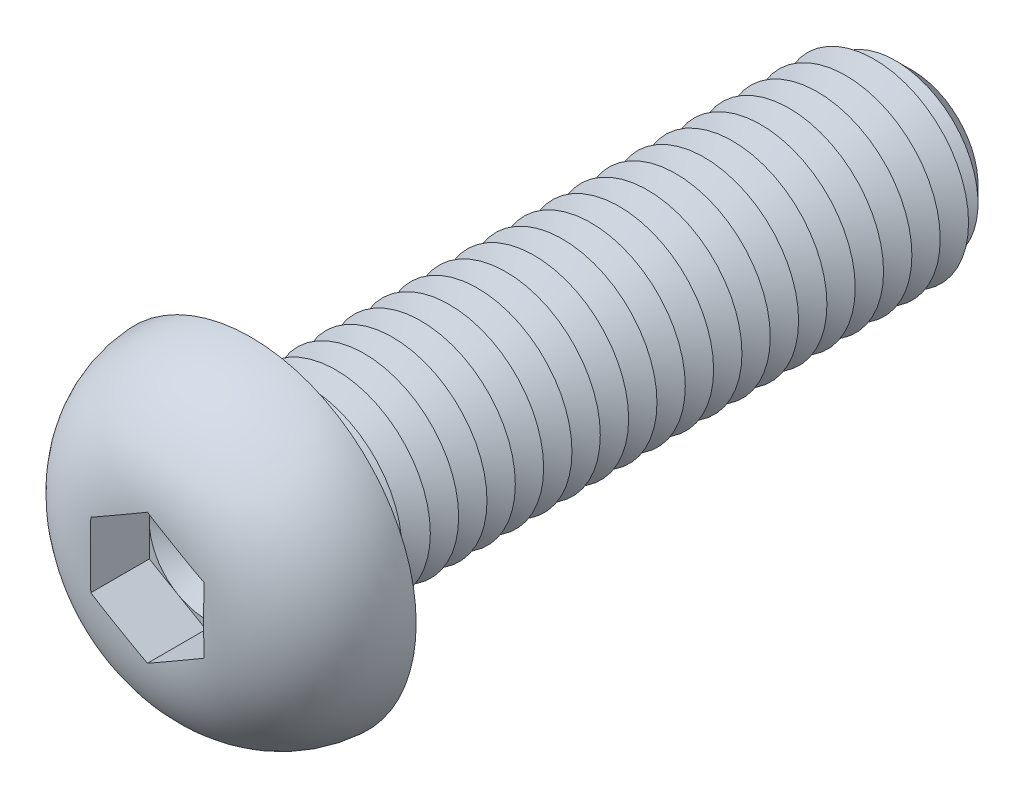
ISO-10303-21;
HEADER;
FILE_DESCRIPTION(('STEP AP214'),'2;1');
FILE_NAME('part.step','',(''),(''),'','','');
FILE_SCHEMA(('AUTOMOTIVE_DESIGN { 1 0 10303 214 1 1 1 1 }'));
ENDSEC;
DATA;
#1=APPLICATION_CONTEXT('core data for automotive mechanical design processes');
#2=APPLICATION_PROTOCOL_DEFINITION('international standard','automotive_design',2000,#1);
#3=PRODUCT_CONTEXT('',#1,'mechanical');
#4=PRODUCT('Part','Part','',(#3));
#5=PRODUCT_RELATED_PRODUCT_CATEGORY('part','',(#4));
#6=PRODUCT_DEFINITION_FORMATION('','',#4);
#7=PRODUCT_DEFINITION_CONTEXT('part definition',#1,'design');
#8=PRODUCT_DEFINITION('design','',#6,#7);
#9=PRODUCT_DEFINITION_SHAPE('','',#8);
#10=(LENGTH_UNIT() NAMED_UNIT(*) SI_UNIT(.MILLI.,.METRE.));
#11=(NAMED_UNIT(*) PLANE_ANGLE_UNIT() SI_UNIT($,.RADIAN.));
#12=(NAMED_UNIT(*) SI_UNIT($,.STERADIAN.) SOLID_ANGLE_UNIT());
#13=UNCERTAINTY_MEASURE_WITH_UNIT(LENGTH_MEASURE(1.E-05),#10,'distance_accuracy_value','');
#14=(GEOMETRIC_REPRESENTATION_CONTEXT(3) GLOBAL_UNCERTAINTY_ASSIGNED_CONTEXT((#13)) GLOBAL_UNIT_ASSIGNED_CONTEXT((#10,
#11,#12)) REPRESENTATION_CONTEXT('',''));
#15=CARTESIAN_POINT('',(0.,0.,0.));
#16=DIRECTION('',(0.,0.,1.));
#17=DIRECTION('',(1.,0.,0.));
#18=AXIS2_PLACEMENT_3D('',#15,#16,#17);
#19=CARTESIAN_POINT('',(0.,0.,2.38));
#20=DIRECTION('',(0.,0.,1.));
#21=DIRECTION('',(1.,0.,0.));
#22=AXIS2_PLACEMENT_3D('',#19,#20,#21);
#23=PLANE('',#22);
#24=CARTESIAN_POINT('',(0.,0.,2.38));
#25=DIRECTION('',(0.,0.,1.));
#26=DIRECTION('',(1.,0.,0.));
#27=AXIS2_PLACEMENT_3D('',#24,#25,#26);
#28=CIRCLE('',#27,3.);
#29=CARTESIAN_POINT('',(3.,0.,2.38));
#30=VERTEX_POINT('',#29);
#31=CARTESIAN_POINT('',(1.5,2.59807621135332,2.38));
#32=VERTEX_POINT('',#31);
#33=EDGE_CURVE('E117',#30,#32,#28,.T.);
#34=ORIENTED_EDGE('',*,*,#33,.F.);
#35=DIRECTION('',(0.,1.,0.));
#36=VECTOR('',#35,1.);
#37=CARTESIAN_POINT('',(3.,-1.73205080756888,2.38));
#38=LINE('',#37,#36);
#39=CARTESIAN_POINT('',(3.,1.73205080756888,2.38));
#40=VERTEX_POINT('',#39);
#41=EDGE_CURVE('E140',#30,#40,#38,.T.);
#42=ORIENTED_EDGE('',*,*,#41,.T.);
#43=DIRECTION('',(-0.866025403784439,0.5,0.));
#44=VECTOR('',#43,1.);
#45=CARTESIAN_POINT('',(3.,1.73205080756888,2.38));
#46=LINE('',#45,#44);
#47=EDGE_CURVE('E136',#40,#32,#46,.T.);
#48=ORIENTED_EDGE('',*,*,#47,.T.);
#49=EDGE_LOOP('',(#34,#42,#48));
#50=FACE_BOUND('',#49,.T.);
#51=ADVANCED_FACE('F39',(#50),#23,.T.);
#52=CARTESIAN_POINT('',(0.,0.,2.38));
#53=DIRECTION('',(0.,0.,1.));
#54=DIRECTION('',(1.,0.,0.));
#55=AXIS2_PLACEMENT_3D('',#52,#53,#54);
#56=CIRCLE('',#55,3.);
#57=CARTESIAN_POINT('',(-1.5,2.59807621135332,2.38));
#58=VERTEX_POINT('',#57);
#59=EDGE_CURVE('E11',#32,#58,#56,.T.);
#60=ORIENTED_EDGE('',*,*,#59,.F.);
#61=CARTESIAN_POINT('',(0.,3.46410161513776,2.38));
#62=VERTEX_POINT('',#61);
#63=EDGE_CURVE('E130',#32,#62,#46,.T.);
#64=ORIENTED_EDGE('',*,*,#63,.T.);
#65=DIRECTION('',(-0.866025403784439,-0.5,0.));
#66=VECTOR('',#65,1.);
#67=CARTESIAN_POINT('',(0.,3.46410161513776,2.38));
#68=LINE('',#67,#66);
#69=EDGE_CURVE('E131',#62,#58,#68,.T.);
#70=ORIENTED_EDGE('',*,*,#69,.T.);
#71=EDGE_LOOP('',(#60,#64,#70));
#72=FACE_BOUND('',#71,.T.);
#73=ADVANCED_FACE('F129',(#72),#23,.T.);
#74=CARTESIAN_POINT('',(-3.,0.,2.38));
#75=VERTEX_POINT('',#74);
#76=EDGE_CURVE('E49',#58,#75,#56,.T.);
#77=ORIENTED_EDGE('',*,*,#76,.F.);
#78=CARTESIAN_POINT('',(-3.,1.73205080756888,2.38));
#79=VERTEX_POINT('',#78);
#80=EDGE_CURVE('E143',#58,#79,#68,.T.);
#81=ORIENTED_EDGE('',*,*,#80,.T.);
#82=DIRECTION('',(0.,-1.,0.));
#83=VECTOR('',#82,1.);
#84=CARTESIAN_POINT('',(-3.,1.73205080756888,2.38));
#85=LINE('',#84,#83);
#86=EDGE_CURVE('E152',#79,#75,#85,.T.);
#87=ORIENTED_EDGE('',*,*,#86,.T.);
#88=EDGE_LOOP('',(#77,#81,#87));
#89=FACE_BOUND('',#88,.T.);
#90=ADVANCED_FACE('F278',(#89),#23,.T.);
#91=CARTESIAN_POINT('',(-1.5,-2.59807621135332,2.38));
#92=VERTEX_POINT('',#91);
#93=EDGE_CURVE('E259',#75,#92,#56,.T.);
#94=ORIENTED_EDGE('',*,*,#93,.F.);
#95=CARTESIAN_POINT('',(-3.,-1.73205080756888,2.38));
#96=VERTEX_POINT('',#95);
#97=EDGE_CURVE('E151',#75,#96,#85,.T.);
#98=ORIENTED_EDGE('',*,*,#97,.T.);
#99=DIRECTION('',(0.866025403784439,-0.5,0.));
#100=VECTOR('',#99,1.);
#101=CARTESIAN_POINT('',(-3.,-1.73205080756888,2.38));
#102=LINE('',#101,#100);
#103=EDGE_CURVE('E157',#96,#92,#102,.T.);
#104=ORIENTED_EDGE('',*,*,#103,.T.);
#105=EDGE_LOOP('',(#94,#98,#104));
#106=FACE_BOUND('',#105,.T.);
#107=ADVANCED_FACE('F272',(#106),#23,.T.);
#108=CARTESIAN_POINT('',(1.5,-2.59807621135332,2.38));
#109=VERTEX_POINT('',#108);
#110=EDGE_CURVE('E56',#92,#109,#56,.T.);
#111=ORIENTED_EDGE('',*,*,#110,.F.);
#112=CARTESIAN_POINT('',(0.,-3.46410161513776,2.38));
#113=VERTEX_POINT('',#112);
#114=EDGE_CURVE('E156',#92,#113,#102,.T.);
#115=ORIENTED_EDGE('',*,*,#114,.T.);
#116=DIRECTION('',(0.866025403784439,0.5,0.));
#117=VECTOR('',#116,1.);
#118=CARTESIAN_POINT('',(0.,-3.46410161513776,2.38));
#119=LINE('',#118,#117);
#120=EDGE_CURVE('E162',#113,#109,#119,.T.);
#121=ORIENTED_EDGE('',*,*,#120,.T.);
#122=EDGE_LOOP('',(#111,#115,#121));
#123=FACE_BOUND('',#122,.T.);
#124=ADVANCED_FACE('F314',(#123),#23,.T.);
#125=CARTESIAN_POINT('',(0.,0.,-35.));
#126=DIRECTION('',(0.,0.,1.));
#127=DIRECTION('',(1.,0.,0.));
#128=AXIS2_PLACEMENT_3D('',#125,#126,#127);
#129=CYLINDRICAL_SURFACE('',#128,5.);
#130=CARTESIAN_POINT('',(0.,0.,-0.600000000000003));
#131=DIRECTION('',(0.,0.,1.));
#132=DIRECTION('',(1.,0.,0.));
#133=AXIS2_PLACEMENT_3D('',#130,#131,#132);
#134=CIRCLE('',#133,5.);
#135=CARTESIAN_POINT('',(5.,0.,-0.600000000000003));
#136=VERTEX_POINT('',#135);
#137=EDGE_CURVE('E241',#136,#136,#134,.F.);
#138=ORIENTED_EDGE('',*,*,#137,.T.);
#139=EDGE_LOOP('',(#138));
#140=FACE_BOUND('',#139,.T.);
#141=CARTESIAN_POINT('',(0.,0.,-1.5));
#142=DIRECTION('',(0.,0.,1.));
#143=DIRECTION('',(1.,0.,0.));
#144=AXIS2_PLACEMENT_3D('',#141,#142,#143);
#145=CIRCLE('',#144,5.00000000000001);
#146=CARTESIAN_POINT('',(5.00000000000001,0.,-1.5));
#147=VERTEX_POINT('',#146);
#148=EDGE_CURVE('E138',#147,#147,#145,.T.);
#149=ORIENTED_EDGE('',*,*,#148,.T.);
#150=EDGE_LOOP('',(#149));
#151=FACE_BOUND('',#150,.T.);
#152=ADVANCED_FACE('F315',(#140,#151),#129,.T.);
#153=CARTESIAN_POINT('',(0.,8.75,0.));
#154=DIRECTION('',(0.,0.,1.));
#155=DIRECTION('',(1.,0.,0.));
#156=AXIS2_PLACEMENT_3D('',#153,#154,#155);
#157=PLANE('',#156);
#158=CARTESIAN_POINT('',(0.,0.,0.));
#159=DIRECTION('',(0.,0.,1.));
#160=DIRECTION('',(1.,0.,0.));
#161=AXIS2_PLACEMENT_3D('',#158,#159,#160);
#162=CIRCLE('',#161,5.6);
#163=CARTESIAN_POINT('',(5.6,0.,0.));
#164=VERTEX_POINT('',#163);
#165=EDGE_CURVE('E250',#164,#164,#162,.T.);
#166=ORIENTED_EDGE('',*,*,#165,.T.);
#167=EDGE_LOOP('',(#166));
#168=FACE_BOUND('',#167,.T.);
#169=CARTESIAN_POINT('',(0.,0.,0.));
#170=DIRECTION('',(0.,0.,1.));
#171=DIRECTION('',(1.,0.,0.));
#172=AXIS2_PLACEMENT_3D('',#169,#170,#171);
#173=CIRCLE('',#172,8.75);
#174=CARTESIAN_POINT('',(8.75,0.,0.));
#175=VERTEX_POINT('',#174);
#176=EDGE_CURVE('E173',#175,#175,#173,.T.);
#177=ORIENTED_EDGE('',*,*,#176,.F.);
#178=EDGE_LOOP('',(#177));
#179=FACE_BOUND('',#178,.T.);
#180=ADVANCED_FACE('F318',(#168,#179),#157,.F.);
#181=CARTESIAN_POINT('',(0.,0.,-0.3));
#182=DIRECTION('',(0.,0.,1.));
#183=DIRECTION('',(1.,0.,0.));
#184=AXIS2_PLACEMENT_3D('',#181,#182,#183);
#185=DEGENERATE_TOROIDAL_SURFACE('',#184,2.95776381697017,5.8,.T.);
#186=CARTESIAN_POINT('',(-3.0002,1.73193533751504,5.47784605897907));
#187=CARTESIAN_POINT('',(-2.87524340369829,1.80407906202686,5.4841525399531));
#188=CARTESIAN_POINT('',(-2.75023731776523,1.87625135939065,5.48853670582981));
#189=CARTESIAN_POINT('',(-2.5001955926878,2.02061301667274,5.49472046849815));
#190=CARTESIAN_POINT('',(-2.37515996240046,2.09280237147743,5.49652051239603));
#191=CARTESIAN_POINT('',(-2.12510741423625,2.23717027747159,5.4987972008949));
#192=CARTESIAN_POINT('',(-2.00009049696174,2.30934882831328,5.49927407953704));
#193=CARTESIAN_POINT('',(-1.75004905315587,2.45371032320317,5.49979859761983));
#194=CARTESIAN_POINT('',(-1.62502452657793,2.52589326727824,5.49984621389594));
#195=CARTESIAN_POINT('',(-1.37497547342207,2.67025915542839,5.49984621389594));
#196=CARTESIAN_POINT('',(-1.24995094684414,2.74244209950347,5.49979859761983));
#197=CARTESIAN_POINT('',(-0.999909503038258,2.88680359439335,5.49927407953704));
#198=CARTESIAN_POINT('',(-0.874892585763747,2.95898214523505,5.4987972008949));
#199=CARTESIAN_POINT('',(-0.624840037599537,3.10335005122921,5.49652051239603));
#200=CARTESIAN_POINT('',(-0.499804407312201,3.1755394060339,5.49472046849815));
#201=CARTESIAN_POINT('',(-0.249762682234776,3.31990106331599,5.48853670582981));
#202=CARTESIAN_POINT('',(-0.124756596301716,3.39207336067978,5.4841525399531));
#203=CARTESIAN_POINT('',(0.000199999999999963,3.46421708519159,5.47784605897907));
#204=B_SPLINE_CURVE_WITH_KNOTS('',3,(#186,#187,#188,#189,#190,#191,#192,#193,#194,#195,#196,
#197,#198,#199,#200,#201,#202,#203),.UNSPECIFIED.,.F.,.F.,(4,2,2,2,2,2,2,2,4),(0.,
0.433225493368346,0.866376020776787,1.29944992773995,1.73254720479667,2.16564448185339,
2.59871838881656,3.031868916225,3.46509440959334),.UNSPECIFIED.);
#205=CARTESIAN_POINT('',(-3.,1.73205080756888,5.4778561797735));
#206=VERTEX_POINT('',#205);
#207=CARTESIAN_POINT('',(0.,3.46410161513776,5.4778561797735));
#208=VERTEX_POINT('',#207);
#209=EDGE_CURVE('E195',#206,#208,#204,.T.);
#210=ORIENTED_EDGE('',*,*,#209,.T.);
#211=CARTESIAN_POINT('',(-0.000200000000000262,3.46421708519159,5.47784605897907));
#212=CARTESIAN_POINT('',(0.124756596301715,3.39207336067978,5.4841525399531));
#213=CARTESIAN_POINT('',(0.249762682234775,3.31990106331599,5.48853670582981));
#214=CARTESIAN_POINT('',(0.4998044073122,3.1755394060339,5.49472046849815));
#215=CARTESIAN_POINT('',(0.624840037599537,3.10335005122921,5.49652051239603));
#216=CARTESIAN_POINT('',(0.874892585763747,2.95898214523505,5.4987972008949));
#217=CARTESIAN_POINT('',(0.999909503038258,2.88680359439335,5.49927407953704));
#218=CARTESIAN_POINT('',(1.24995094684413,2.74244209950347,5.49979859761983));
#219=CARTESIAN_POINT('',(1.37497547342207,2.67025915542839,5.49984621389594));
#220=CARTESIAN_POINT('',(1.62502452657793,2.52589326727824,5.49984621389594));
#221=CARTESIAN_POINT('',(1.75004905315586,2.45371032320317,5.49979859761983));
#222=CARTESIAN_POINT('',(2.00009049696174,2.30934882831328,5.49927407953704));
#223=CARTESIAN_POINT('',(2.12510741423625,2.23717027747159,5.4987972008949));
#224=CARTESIAN_POINT('',(2.37515996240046,2.09280237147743,5.49652051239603));
#225=CARTESIAN_POINT('',(2.5001955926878,2.02061301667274,5.49472046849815));
#226=CARTESIAN_POINT('',(2.75023731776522,1.87625135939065,5.48853670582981));
#227=CARTESIAN_POINT('',(2.87524340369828,1.80407906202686,5.4841525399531));
#228=CARTESIAN_POINT('',(3.0002,1.73193533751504,5.47784605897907));
#229=B_SPLINE_CURVE_WITH_KNOTS('',3,(#211,#212,#213,#214,#215,#216,#217,#218,#219,#220,#221,
#222,#223,#224,#225,#226,#227,#228),.UNSPECIFIED.,.F.,.F.,(4,2,2,2,2,2,2,2,4),(0.,
0.433225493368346,0.866376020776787,1.29944992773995,1.73254720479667,2.16564448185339,
2.59871838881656,3.031868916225,3.46509440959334),.UNSPECIFIED.);
#230=CARTESIAN_POINT('',(3.,1.73205080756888,5.47785617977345));
#231=VERTEX_POINT('',#230);
#232=EDGE_CURVE('E224',#208,#231,#229,.T.);
#233=ORIENTED_EDGE('',*,*,#232,.T.);
#234=CARTESIAN_POINT('',(3.,0.,5.49984621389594));
#235=CARTESIAN_POINT('',(3.,-0.125570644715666,5.49984449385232));
#236=CARTESIAN_POINT('',(3.,-0.251141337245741,5.49980426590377));
#237=CARTESIAN_POINT('',(3.,-0.502283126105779,5.499449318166));
#238=CARTESIAN_POINT('',(3.,-0.62785422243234,5.49913459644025));
#239=CARTESIAN_POINT('',(3.,-0.879037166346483,5.49770394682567));
#240=CARTESIAN_POINT('',(3.,-1.00464901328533,5.49658774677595));
#241=CARTESIAN_POINT('',(3.,-1.2558477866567,5.49279605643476));
#242=CARTESIAN_POINT('',(3.,-1.38143471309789,5.49012056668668));
#243=CARTESIAN_POINT('',(3.,-1.7568847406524,5.47847778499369));
#244=CARTESIAN_POINT('',(3.,-2.00667103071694,5.46590367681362));
#245=CARTESIAN_POINT('',(3.,-2.50488375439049,5.42441448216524));
#246=CARTESIAN_POINT('',(3.,-2.75331093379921,5.3955095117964));
#247=CARTESIAN_POINT('',(3.,-3.18719021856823,5.32582626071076));
#248=CARTESIAN_POINT('',(3.,-3.3733635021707,5.28960049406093));
#249=CARTESIAN_POINT('',(3.,-3.74245496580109,5.20330651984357));
#250=CARTESIAN_POINT('',(3.,-3.92537417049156,5.15324275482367));
#251=CARTESIAN_POINT('',(3.,-4.28675502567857,5.03819885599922));
#252=CARTESIAN_POINT('',(3.,-4.46521058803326,4.97319946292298));
#253=CARTESIAN_POINT('',(3.,-4.81576789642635,4.82782766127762));
#254=CARTESIAN_POINT('',(3.,-4.98786985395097,4.74745576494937));
#255=CARTESIAN_POINT('',(3.,-5.3254008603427,4.5705398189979));
#256=CARTESIAN_POINT('',(3.,-5.49076268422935,4.47386710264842));
#257=CARTESIAN_POINT('',(3.,-5.81151175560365,4.26514040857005));
#258=CARTESIAN_POINT('',(3.,-5.96689840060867,4.15308550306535));
#259=CARTESIAN_POINT('',(3.,-6.26591787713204,3.91428862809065));
#260=CARTESIAN_POINT('',(3.,-6.40955257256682,3.78754899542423));
#261=CARTESIAN_POINT('',(3.,-6.68342295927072,3.52034797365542));
#262=CARTESIAN_POINT('',(3.,-6.81366070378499,3.3798886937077));
#263=CARTESIAN_POINT('',(3.,-7.0426666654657,3.10626157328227));
#264=CARTESIAN_POINT('',(3.,-7.1433109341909,2.97465879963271));
#265=CARTESIAN_POINT('',(3.,-7.33253056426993,2.70304716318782));
#266=CARTESIAN_POINT('',(3.,-7.42110686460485,2.56303895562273));
#267=CARTESIAN_POINT('',(3.,-7.58534868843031,2.27573732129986));
#268=CARTESIAN_POINT('',(3.,-7.66102067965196,2.12844759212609));
#269=CARTESIAN_POINT('',(3.,-7.79881901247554,1.82765987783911));
#270=CARTESIAN_POINT('',(3.,-7.86094563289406,1.67416202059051));
#271=CARTESIAN_POINT('',(3.,-7.96803488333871,1.37082076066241));
#272=CARTESIAN_POINT('',(3.,-8.01375687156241,1.22124490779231));
#273=CARTESIAN_POINT('',(3.,-8.09224398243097,0.918674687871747));
#274=CARTESIAN_POINT('',(3.,-8.12500479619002,0.765679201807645));
#275=CARTESIAN_POINT('',(3.,-8.17726457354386,0.457507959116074));
#276=CARTESIAN_POINT('',(3.,-8.1967692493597,0.302333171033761));
#277=CARTESIAN_POINT('',(3.,-8.22238322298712,-0.00917738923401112));
#278=CARTESIAN_POINT('',(3.,-8.22848754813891,-0.165513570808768));
#279=CARTESIAN_POINT('',(3.,-8.22724693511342,-0.475358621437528));
#280=CARTESIAN_POINT('',(3.,-8.2201384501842,-0.628868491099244));
#281=CARTESIAN_POINT('',(3.,-8.1929851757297,-0.934809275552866));
#282=CARTESIAN_POINT('',(3.,-8.17293462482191,-1.0872396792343));
#283=CARTESIAN_POINT('',(3.,-8.1200547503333,-1.38984943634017));
#284=CARTESIAN_POINT('',(3.,-8.08722683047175,-1.54002903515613));
#285=CARTESIAN_POINT('',(3.,-8.0090712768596,-1.83702738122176));
#286=CARTESIAN_POINT('',(3.,-7.96374919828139,-1.98384759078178));
#287=CARTESIAN_POINT('',(3.,-7.86096457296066,-2.27315566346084));
#288=CARTESIAN_POINT('',(3.,-7.80350334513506,-2.41564399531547));
#289=CARTESIAN_POINT('',(3.,-7.67691451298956,-2.6952770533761));
#290=CARTESIAN_POINT('',(3.,-7.60779108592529,-2.83242367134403));
#291=CARTESIAN_POINT('',(3.,-7.45837210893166,-3.10056990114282));
#292=CARTESIAN_POINT('',(3.,-7.37807144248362,-3.23156666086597));
#293=CARTESIAN_POINT('',(3.,-7.20697634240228,-3.48645411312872));
#294=CARTESIAN_POINT('',(3.,-7.11618520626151,-3.61034702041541));
#295=CARTESIAN_POINT('',(3.,-6.92334779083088,-3.85210954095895));
#296=CARTESIAN_POINT('',(3.,-6.82115263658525,-3.96986038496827));
#297=CARTESIAN_POINT('',(3.,-6.60745266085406,-4.19658717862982));
#298=CARTESIAN_POINT('',(3.,-6.49594754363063,-4.30556284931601));
#299=CARTESIAN_POINT('',(3.,-6.26450055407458,-4.51413072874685));
#300=CARTESIAN_POINT('',(3.,-6.14455919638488,-4.61372350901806));
#301=CARTESIAN_POINT('',(3.,-5.8971402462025,-4.80306090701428));
#302=CARTESIAN_POINT('',(3.,-5.76966228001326,-4.89280503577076));
#303=CARTESIAN_POINT('',(3.,-5.50268934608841,-5.06561354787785));
#304=CARTESIAN_POINT('',(3.,-5.36291526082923,-5.14824654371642));
#305=CARTESIAN_POINT('',(3.,-5.07726499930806,-5.30226841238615));
#306=CARTESIAN_POINT('',(3.,-4.93138704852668,-5.37365398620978));
#307=CARTESIAN_POINT('',(3.,-4.63484455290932,-5.50505544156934));
#308=CARTESIAN_POINT('',(3.,-4.48418671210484,-5.56508649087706));
#309=CARTESIAN_POINT('',(3.,-4.17906596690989,-5.6740700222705));
#310=CARTESIAN_POINT('',(3.,-4.02460600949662,-5.72303080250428));
#311=CARTESIAN_POINT('',(3.,-3.6739247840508,-5.82125760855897));
#312=CARTESIAN_POINT('',(3.,-3.47687521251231,-5.86756841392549));
#313=CARTESIAN_POINT('',(3.,-3.07981530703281,-5.94521593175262));
#314=CARTESIAN_POINT('',(3.,-2.87980357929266,-5.97654534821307));
#315=CARTESIAN_POINT('',(3.,-2.47751859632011,-6.02656554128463));
#316=CARTESIAN_POINT('',(3.,-2.27523974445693,-6.0452096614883));
#317=CARTESIAN_POINT('',(3.,-1.8700786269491,-6.07274849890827));
#318=CARTESIAN_POINT('',(3.,-1.66719636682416,-6.08164330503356));
#319=CARTESIAN_POINT('',(3.,-1.25887867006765,-6.09343726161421));
#320=CARTESIAN_POINT('',(3.,-1.05344157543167,-6.09626381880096));
#321=CARTESIAN_POINT('',(3.,-0.745285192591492,-6.0985660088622));
#322=CARTESIAN_POINT('',(3.,-0.642567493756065,-6.09901047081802));
#323=CARTESIAN_POINT('',(3.,-0.437131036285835,-6.09957976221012));
#324=CARTESIAN_POINT('',(3.,-0.334412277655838,-6.09970459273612));
#325=CARTESIAN_POINT('',(3.,-0.129132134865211,-6.09984385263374));
#326=CARTESIAN_POINT('',(3.,-0.0265707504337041,-6.09985845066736));
#327=CARTESIAN_POINT('',(3.,0.178552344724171,-6.09981980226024));
#328=CARTESIAN_POINT('',(3.,0.281114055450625,-6.09976655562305));
#329=CARTESIAN_POINT('',(3.,0.486235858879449,-6.09946703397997));
#330=CARTESIAN_POINT('',(3.,0.588795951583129,-6.0992207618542));
#331=CARTESIAN_POINT('',(3.,0.793913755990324,-6.09826017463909));
#332=CARTESIAN_POINT('',(3.,0.896471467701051,-6.097545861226));
#333=CARTESIAN_POINT('',(3.,1.11088851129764,-6.0951586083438));
#334=CARTESIAN_POINT('',(3.,1.22274716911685,-6.0934045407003));
#335=CARTESIAN_POINT('',(3.,1.44642575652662,-6.08829151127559));
#336=CARTESIAN_POINT('',(3.,1.55824568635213,-6.08493255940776));
#337=CARTESIAN_POINT('',(3.,1.89360474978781,-6.07150074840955));
#338=CARTESIAN_POINT('',(3.,2.11703989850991,-6.05807293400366));
#339=CARTESIAN_POINT('',(3.,2.56083256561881,-6.01778675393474));
#340=CARTESIAN_POINT('',(3.,2.78120000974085,-5.99104517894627));
#341=CARTESIAN_POINT('',(3.,3.2192866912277,-5.92065658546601));
#342=CARTESIAN_POINT('',(3.,3.43700630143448,-5.8770119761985));
#343=CARTESIAN_POINT('',(3.,3.82666678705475,-5.78060449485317));
#344=CARTESIAN_POINT('',(3.,3.99942726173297,-5.73116262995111));
#345=CARTESIAN_POINT('',(3.,4.3405567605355,-5.61888897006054));
#346=CARTESIAN_POINT('',(3.,4.50892617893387,-5.55605838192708));
#347=CARTESIAN_POINT('',(3.,4.84049143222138,-5.41635874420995));
#348=CARTESIAN_POINT('',(3.,5.00366586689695,-5.33943871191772));
#349=CARTESIAN_POINT('',(3.,5.32271829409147,-5.17167128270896));
#350=CARTESIAN_POINT('',(3.,5.47859600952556,-5.0808233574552));
#351=CARTESIAN_POINT('',(3.,5.7822829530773,-4.88500135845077));
#352=CARTESIAN_POINT('',(3.,5.93005015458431,-4.77996197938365));
#353=CARTESIAN_POINT('',(3.,6.21523046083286,-4.55663689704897));
#354=CARTESIAN_POINT('',(3.,6.35264336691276,-4.43835093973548));
#355=CARTESIAN_POINT('',(3.,6.61552762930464,-4.18948618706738));
#356=CARTESIAN_POINT('',(3.,6.74101380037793,-4.05892305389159));
#357=CARTESIAN_POINT('',(3.,6.97891308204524,-3.78639059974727));
#358=CARTESIAN_POINT('',(3.,7.09132750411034,-3.64442242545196));
#359=CARTESIAN_POINT('',(3.,7.29113623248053,-3.36530209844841));
#360=CARTESIAN_POINT('',(3.,7.37991316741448,-3.22913733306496));
#361=CARTESIAN_POINT('',(3.,7.5451968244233,-2.94955428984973));
#362=CARTESIAN_POINT('',(3.,7.62170419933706,-2.80613639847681));
#363=CARTESIAN_POINT('',(3.,7.76177641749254,-2.5131168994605));
#364=CARTESIAN_POINT('',(3.,7.82534152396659,-2.36351541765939));
#365=CARTESIAN_POINT('',(3.,7.93897019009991,-2.05926799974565));
#366=CARTESIAN_POINT('',(3.,7.98903395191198,-1.9046221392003));
#367=CARTESIAN_POINT('',(3.,8.07336540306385,-1.59821781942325));
#368=CARTESIAN_POINT('',(3.,8.10821878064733,-1.44662026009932));
#369=CARTESIAN_POINT('',(3.,8.16487862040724,-1.14095089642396));
#370=CARTESIAN_POINT('',(3.,8.18668070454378,-0.986878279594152));
#371=CARTESIAN_POINT('',(3.,8.21703234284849,-0.677515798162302));
#372=CARTESIAN_POINT('',(3.,8.22558889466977,-0.522226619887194));
#373=CARTESIAN_POINT('',(3.,8.22940229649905,-0.211427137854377));
#374=CARTESIAN_POINT('',(3.,8.22465425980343,-0.0559167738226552));
#375=CARTESIAN_POINT('',(3.,8.20204101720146,0.252033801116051));
#376=CARTESIAN_POINT('',(3.,8.18435378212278,0.404487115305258));
#377=CARTESIAN_POINT('',(3.,8.136196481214,0.707418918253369));
#378=CARTESIAN_POINT('',(3.,8.1057217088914,0.857896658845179));
#379=CARTESIAN_POINT('',(3.,8.03224632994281,1.15569567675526));
#380=CARTESIAN_POINT('',(3.,7.9892508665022,1.30301822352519));
#381=CARTESIAN_POINT('',(3.,7.89104818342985,1.59360769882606));
#382=CARTESIAN_POINT('',(3.,7.83583549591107,1.73687277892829));
#383=CARTESIAN_POINT('',(3.,7.71349498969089,2.01864020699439));
#384=CARTESIAN_POINT('',(3.,7.64633814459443,2.1571299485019));
#385=CARTESIAN_POINT('',(3.,7.50076383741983,2.42797950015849));
#386=CARTESIAN_POINT('',(3.,7.42235122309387,2.56034191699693));
#387=CARTESIAN_POINT('',(3.,7.25483284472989,2.8181715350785));
#388=CARTESIAN_POINT('',(3.,7.16572386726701,2.94363664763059));
#389=CARTESIAN_POINT('',(3.,6.9775559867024,3.1867979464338));
#390=CARTESIAN_POINT('',(3.,6.87850037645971,3.30449668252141));
#391=CARTESIAN_POINT('',(3.,6.66919743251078,3.53363644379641));
#392=CARTESIAN_POINT('',(3.,6.55877281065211,3.6449154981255));
#393=CARTESIAN_POINT('',(3.,6.32925753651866,3.85806320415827));
#394=CARTESIAN_POINT('',(3.,6.21016952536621,3.95993470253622));
#395=CARTESIAN_POINT('',(3.,5.96413069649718,4.15386505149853));
#396=CARTESIAN_POINT('',(3.,5.83717459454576,4.24591719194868));
#397=CARTESIAN_POINT('',(3.,5.5764653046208,4.41973423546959));
#398=CARTESIAN_POINT('',(3.,5.4427139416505,4.50150188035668));
#399=CARTESIAN_POINT('',(3.,5.16249709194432,4.65840017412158));
#400=CARTESIAN_POINT('',(3.,5.01573037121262,4.73299250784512));
#401=CARTESIAN_POINT('',(3.,4.71685583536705,4.87057528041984));
#402=CARTESIAN_POINT('',(3.,4.56474751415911,4.93356461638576));
#403=CARTESIAN_POINT('',(3.,4.25657035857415,5.04801407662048));
#404=CARTESIAN_POINT('',(3.,4.10050882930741,5.09949395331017));
#405=CARTESIAN_POINT('',(3.,3.78523286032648,5.19149003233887));
#406=CARTESIAN_POINT('',(3.,3.62601895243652,5.23200806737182));
#407=CARTESIAN_POINT('',(3.,3.32461902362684,5.29856444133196));
#408=CARTESIAN_POINT('',(3.,3.18268434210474,5.32575733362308));
#409=CARTESIAN_POINT('',(3.,2.89760844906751,5.3729307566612));
#410=CARTESIAN_POINT('',(3.,2.75446703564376,5.39291005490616));
#411=CARTESIAN_POINT('',(3.,2.46730946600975,5.42656527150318));
#412=CARTESIAN_POINT('',(3.,2.32329255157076,5.44023457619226));
#413=CARTESIAN_POINT('',(3.,2.03487642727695,5.46234228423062));
#414=CARTESIAN_POINT('',(3.,1.89047722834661,5.4707808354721));
#415=CARTESIAN_POINT('',(3.,1.60058090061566,5.48373897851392));
#416=CARTESIAN_POINT('',(3.,1.45508270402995,5.48823290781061));
#417=CARTESIAN_POINT('',(3.,1.16402671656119,5.49458098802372));
#418=CARTESIAN_POINT('',(3.,1.01846892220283,5.49643495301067));
#419=CARTESIAN_POINT('',(3.,0.72742451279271,5.49877506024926));
#420=CARTESIAN_POINT('',(3.,0.581937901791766,5.49926194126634));
#421=CARTESIAN_POINT('',(3.,0.290967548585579,5.49979850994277));
#422=CARTESIAN_POINT('',(3.,0.145483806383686,5.49984820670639));
#423=CARTESIAN_POINT('',(3.,0.,5.49984621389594));
#424=B_SPLINE_CURVE_WITH_KNOTS('',3,(#234,#235,#236,#237,#238,#239,#240,#241,#242,#243,#244,
#245,#246,#247,#248,#249,#250,#251,#252,#253,#254,#255,#256,#257,#258,#259,#260,#261,#262,#263,
#264,#265,#266,#267,#268,#269,#270,#271,#272,#273,#274,#275,#276,#277,#278,#279,#280,#281,#282,
#283,#284,#285,#286,#287,#288,#289,#290,#291,#292,#293,#294,#295,#296,#297,#298,#299,#300,#301,
#302,#303,#304,#305,#306,#307,#308,#309,#310,#311,#312,#313,#314,#315,#316,#317,#318,#319,#320,
#321,#322,#323,#324,#325,#326,#327,#328,#329,#330,#331,#332,#333,#334,#335,#336,#337,#338,#339,
#340,#341,#342,#343,#344,#345,#346,#347,#348,#349,#350,#351,#352,#353,#354,#355,#356,#357,#358,
#359,#360,#361,#362,#363,#364,#365,#366,#367,#368,#369,#370,#371,#372,#373,#374,#375,#376,#377,
#378,#379,#380,#381,#382,#383,#384,#385,#386,#387,#388,#389,#390,#391,#392,#393,#394,#395,#396,
#397,#398,#399,#400,#401,#402,#403,#404,#405,#406,#407,#408,#409,#410,#411,#412,#413,#414,#415,
#416,#417,#418,#419,#420,#421,#422,#423),.UNSPECIFIED.,.T.,.F.,(4,2,2,2,2,2,2,2,2,2,2,2,2,2,2,2,
2,2,2,2,2,2,2,2,2,2,2,2,2,2,2,2,2,2,2,2,2,2,2,2,2,2,2,2,2,2,2,2,2,2,2,2,2,2,2,2,2,2,2,2,2,2,2,2,
2,2,2,2,2,2,2,2,2,2,2,2,2,2,2,2,2,2,2,2,2,2,2,2,2,2,2,2,2,2,4),(0.,0.376711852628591,
0.753426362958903,1.13026885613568,1.50711121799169,2.257095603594,3.00661592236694,
3.57514719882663,4.14349616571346,4.71258216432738,5.28164920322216,5.85543852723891,
6.42926247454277,7.00299523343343,7.57663992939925,8.07303876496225,8.56939895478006,
9.06550962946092,9.56161009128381,10.030267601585,10.4990807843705,10.9676918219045,
11.4364767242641,11.8969530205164,12.3576344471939,12.8182652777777,13.2786916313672,
13.7390679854,14.1992797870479,14.6597029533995,15.1199817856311,15.5871904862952,
16.0544140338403,16.5216091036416,16.9888273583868,17.4754224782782,17.9621600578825,
18.4482427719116,18.9339599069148,19.5405320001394,20.1473991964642,20.7564865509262,
21.3655683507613,21.9818967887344,22.2900536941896,22.5982095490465,22.905893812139,
23.2135789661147,23.5212595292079,23.8289389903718,24.1645461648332,24.5001512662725,
25.171371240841,25.8368042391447,26.5021424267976,27.0407309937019,27.5792710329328,
28.119799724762,28.660348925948,29.2034761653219,29.7466138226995,30.2890677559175,
30.831467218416,31.3185063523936,31.8055195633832,32.2925228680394,32.779518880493,
33.2456153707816,33.7118681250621,34.1778744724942,34.6440520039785,35.103935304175,
35.563988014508,36.0238520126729,36.4839222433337,36.9451261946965,37.4061321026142,
37.8672768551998,38.3282694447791,38.7980460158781,39.2676799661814,39.7376328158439,
40.207460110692,40.7008436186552,41.1942739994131,41.6868509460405,42.1793454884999,
42.6126940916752,43.0461167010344,43.479992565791,43.9138561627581,44.3505218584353,
44.7872183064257,45.2236787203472,45.6601300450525),.UNSPECIFIED.);
#425=CARTESIAN_POINT('',(3.,-1.73205080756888,5.4778561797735));
#426=VERTEX_POINT('',#425);
#427=EDGE_CURVE('E233',#231,#426,#424,.T.);
#428=ORIENTED_EDGE('',*,*,#427,.T.);
#429=CARTESIAN_POINT('',(3.0002,-1.73193533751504,5.47784605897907));
#430=CARTESIAN_POINT('',(2.87524340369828,-1.80407906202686,5.4841525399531));
#431=CARTESIAN_POINT('',(2.75023731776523,-1.87625135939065,5.48853670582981));
#432=CARTESIAN_POINT('',(2.5001955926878,-2.02061301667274,5.49472046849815));
#433=CARTESIAN_POINT('',(2.37515996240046,-2.09280237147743,5.49652051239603));
#434=CARTESIAN_POINT('',(2.12510741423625,-2.23717027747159,5.4987972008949));
#435=CARTESIAN_POINT('',(2.00009049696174,-2.30934882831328,5.49927407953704));
#436=CARTESIAN_POINT('',(1.75004905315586,-2.45371032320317,5.49979859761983));
#437=CARTESIAN_POINT('',(1.62502452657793,-2.52589326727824,5.49984621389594));
#438=CARTESIAN_POINT('',(1.37497547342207,-2.67025915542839,5.49984621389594));
#439=CARTESIAN_POINT('',(1.24995094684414,-2.74244209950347,5.49979859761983));
#440=CARTESIAN_POINT('',(0.999909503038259,-2.88680359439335,5.49927407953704));
#441=CARTESIAN_POINT('',(0.874892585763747,-2.95898214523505,5.4987972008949));
#442=CARTESIAN_POINT('',(0.624840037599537,-3.10335005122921,5.49652051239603));
#443=CARTESIAN_POINT('',(0.499804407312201,-3.1755394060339,5.49472046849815));
#444=CARTESIAN_POINT('',(0.249762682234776,-3.31990106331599,5.48853670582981));
#445=CARTESIAN_POINT('',(0.124756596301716,-3.39207336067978,5.4841525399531));
#446=CARTESIAN_POINT('',(-0.000199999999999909,-3.46421708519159,5.47784605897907));
#447=B_SPLINE_CURVE_WITH_KNOTS('',3,(#429,#430,#431,#432,#433,#434,#435,#436,#437,#438,#439,
#440,#441,#442,#443,#444,#445,#446),.UNSPECIFIED.,.F.,.F.,(4,2,2,2,2,2,2,2,4),(0.,
0.433225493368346,0.866376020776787,1.29944992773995,1.73254720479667,2.16564448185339,
2.59871838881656,3.031868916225,3.46509440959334),.UNSPECIFIED.);
#448=CARTESIAN_POINT('',(0.,-3.46410161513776,5.4778561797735));
#449=VERTEX_POINT('',#448);
#450=EDGE_CURVE('E287',#426,#449,#447,.T.);
#451=ORIENTED_EDGE('',*,*,#450,.T.);
#452=CARTESIAN_POINT('',(0.000200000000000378,-3.46421708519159,5.47784605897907));
#453=CARTESIAN_POINT('',(-0.124756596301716,-3.39207336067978,5.4841525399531));
#454=CARTESIAN_POINT('',(-0.249762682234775,-3.31990106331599,5.48853670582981));
#455=CARTESIAN_POINT('',(-0.499804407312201,-3.1755394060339,5.49472046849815));
#456=CARTESIAN_POINT('',(-0.624840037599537,-3.10335005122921,5.49652051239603));
#457=CARTESIAN_POINT('',(-0.874892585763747,-2.95898214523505,5.4987972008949));
#458=CARTESIAN_POINT('',(-0.999909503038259,-2.88680359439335,5.49927407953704));
#459=CARTESIAN_POINT('',(-1.24995094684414,-2.74244209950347,5.49979859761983));
#460=CARTESIAN_POINT('',(-1.37497547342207,-2.67025915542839,5.49984621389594));
#461=CARTESIAN_POINT('',(-1.62502452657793,-2.52589326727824,5.49984621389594));
#462=CARTESIAN_POINT('',(-1.75004905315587,-2.45371032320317,5.49979859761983));
#463=CARTESIAN_POINT('',(-2.00009049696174,-2.30934882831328,5.49927407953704));
#464=CARTESIAN_POINT('',(-2.12510741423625,-2.23717027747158,5.4987972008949));
#465=CARTESIAN_POINT('',(-2.37515996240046,-2.09280237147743,5.49652051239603));
#466=CARTESIAN_POINT('',(-2.5001955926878,-2.02061301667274,5.49472046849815));
#467=CARTESIAN_POINT('',(-2.75023731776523,-1.87625135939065,5.48853670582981));
#468=CARTESIAN_POINT('',(-2.87524340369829,-1.80407906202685,5.4841525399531));
#469=CARTESIAN_POINT('',(-3.0002,-1.73193533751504,5.47784605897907));
#470=B_SPLINE_CURVE_WITH_KNOTS('',3,(#452,#453,#454,#455,#456,#457,#458,#459,#460,#461,#462,
#463,#464,#465,#466,#467,#468,#469),.UNSPECIFIED.,.F.,.F.,(4,2,2,2,2,2,2,2,4),(0.,
0.433225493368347,0.866376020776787,1.29944992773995,1.73254720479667,2.16564448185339,
2.59871838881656,3.031868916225,3.46509440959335),.UNSPECIFIED.);
#471=CARTESIAN_POINT('',(-3.,-1.73205080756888,5.47785617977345));
#472=VERTEX_POINT('',#471);
#473=EDGE_CURVE('E285',#449,#472,#470,.T.);
#474=ORIENTED_EDGE('',*,*,#473,.T.);
#475=CARTESIAN_POINT('',(-3.,0.,5.49984621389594));
#476=CARTESIAN_POINT('',(-3.,0.125570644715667,5.49984449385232));
#477=CARTESIAN_POINT('',(-3.,0.251141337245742,5.49980426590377));
#478=CARTESIAN_POINT('',(-3.,0.50228312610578,5.499449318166));
#479=CARTESIAN_POINT('',(-3.,0.627854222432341,5.49913459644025));
#480=CARTESIAN_POINT('',(-3.,0.879037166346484,5.49770394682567));
#481=CARTESIAN_POINT('',(-3.,1.00464901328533,5.49658774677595));
#482=CARTESIAN_POINT('',(-3.,1.2558477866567,5.49279605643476));
#483=CARTESIAN_POINT('',(-3.,1.3814347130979,5.49012056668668));
#484=CARTESIAN_POINT('',(-3.,1.7568847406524,5.47847778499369));
#485=CARTESIAN_POINT('',(-3.,2.00667103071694,5.46590367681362));
#486=CARTESIAN_POINT('',(-3.,2.50488375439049,5.42441448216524));
#487=CARTESIAN_POINT('',(-3.,2.75331093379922,5.3955095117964));
#488=CARTESIAN_POINT('',(-3.,3.18719021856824,5.32582626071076));
#489=CARTESIAN_POINT('',(-3.,3.3733635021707,5.28960049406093));
#490=CARTESIAN_POINT('',(-3.,3.74245496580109,5.20330651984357));
#491=CARTESIAN_POINT('',(-3.,3.92537417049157,5.15324275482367));
#492=CARTESIAN_POINT('',(-3.,4.28675502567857,5.03819885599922));
#493=CARTESIAN_POINT('',(-3.,4.46521058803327,4.97319946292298));
#494=CARTESIAN_POINT('',(-3.,4.81576789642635,4.82782766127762));
#495=CARTESIAN_POINT('',(-3.,4.98786985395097,4.74745576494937));
#496=CARTESIAN_POINT('',(-3.,5.3254008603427,4.5705398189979));
#497=CARTESIAN_POINT('',(-3.,5.49076268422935,4.47386710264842));
#498=CARTESIAN_POINT('',(-3.,5.81151175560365,4.26514040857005));
#499=CARTESIAN_POINT('',(-3.,5.96689840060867,4.15308550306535));
#500=CARTESIAN_POINT('',(-3.,6.26591787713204,3.91428862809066));
#501=CARTESIAN_POINT('',(-3.,6.40955257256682,3.78754899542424));
#502=CARTESIAN_POINT('',(-3.,6.68342295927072,3.52034797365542));
#503=CARTESIAN_POINT('',(-3.,6.81366070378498,3.3798886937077));
#504=CARTESIAN_POINT('',(-3.,7.0426666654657,3.10626157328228));
#505=CARTESIAN_POINT('',(-3.,7.14331093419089,2.97465879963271));
#506=CARTESIAN_POINT('',(-3.,7.33253056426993,2.70304716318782));
#507=CARTESIAN_POINT('',(-3.,7.42110686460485,2.56303895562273));
#508=CARTESIAN_POINT('',(-3.,7.58534868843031,2.27573732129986));
#509=CARTESIAN_POINT('',(-3.,7.66102067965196,2.12844759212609));
#510=CARTESIAN_POINT('',(-3.,7.79881901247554,1.82765987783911));
#511=CARTESIAN_POINT('',(-3.,7.86094563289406,1.67416202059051));
#512=CARTESIAN_POINT('',(-3.,7.96803488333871,1.37082076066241));
#513=CARTESIAN_POINT('',(-3.,8.01375687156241,1.22124490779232));
#514=CARTESIAN_POINT('',(-3.,8.09224398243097,0.918674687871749));
#515=CARTESIAN_POINT('',(-3.,8.12500479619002,0.765679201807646));
#516=CARTESIAN_POINT('',(-3.,8.17726457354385,0.457507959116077));
#517=CARTESIAN_POINT('',(-3.,8.1967692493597,0.302333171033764));
#518=CARTESIAN_POINT('',(-3.,8.22238322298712,-0.00917738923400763));
#519=CARTESIAN_POINT('',(-3.,8.22848754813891,-0.165513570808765));
#520=CARTESIAN_POINT('',(-3.,8.22724693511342,-0.475358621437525));
#521=CARTESIAN_POINT('',(-3.,8.2201384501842,-0.628868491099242));
#522=CARTESIAN_POINT('',(-3.,8.1929851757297,-0.934809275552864));
#523=CARTESIAN_POINT('',(-3.,8.17293462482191,-1.08723967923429));
#524=CARTESIAN_POINT('',(-3.,8.1200547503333,-1.38984943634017));
#525=CARTESIAN_POINT('',(-3.,8.08722683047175,-1.54002903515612));
#526=CARTESIAN_POINT('',(-3.,8.0090712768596,-1.83702738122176));
#527=CARTESIAN_POINT('',(-3.,7.96374919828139,-1.98384759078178));
#528=CARTESIAN_POINT('',(-3.,7.86096457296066,-2.27315566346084));
#529=CARTESIAN_POINT('',(-3.,7.80350334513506,-2.41564399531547));
#530=CARTESIAN_POINT('',(-3.,7.67691451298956,-2.69527705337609));
#531=CARTESIAN_POINT('',(-3.,7.60779108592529,-2.83242367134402));
#532=CARTESIAN_POINT('',(-3.,7.45837210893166,-3.10056990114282));
#533=CARTESIAN_POINT('',(-3.,7.37807144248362,-3.23156666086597));
#534=CARTESIAN_POINT('',(-3.,7.20697634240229,-3.48645411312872));
#535=CARTESIAN_POINT('',(-3.,7.11618520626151,-3.61034702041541));
#536=CARTESIAN_POINT('',(-3.,6.92334779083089,-3.85210954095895));
#537=CARTESIAN_POINT('',(-3.,6.82115263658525,-3.96986038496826));
#538=CARTESIAN_POINT('',(-3.,6.60745266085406,-4.19658717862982));
#539=CARTESIAN_POINT('',(-3.,6.49594754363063,-4.30556284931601));
#540=CARTESIAN_POINT('',(-3.,6.26450055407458,-4.51413072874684));
#541=CARTESIAN_POINT('',(-3.,6.14455919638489,-4.61372350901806));
#542=CARTESIAN_POINT('',(-3.,5.8971402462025,-4.80306090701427));
#543=CARTESIAN_POINT('',(-3.,5.76966228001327,-4.89280503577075));
#544=CARTESIAN_POINT('',(-3.,5.50268934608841,-5.06561354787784));
#545=CARTESIAN_POINT('',(-3.,5.36291526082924,-5.14824654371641));
#546=CARTESIAN_POINT('',(-3.,5.07726499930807,-5.30226841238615));
#547=CARTESIAN_POINT('',(-3.,4.93138704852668,-5.37365398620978));
#548=CARTESIAN_POINT('',(-3.,4.63484455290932,-5.50505544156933));
#549=CARTESIAN_POINT('',(-3.,4.48418671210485,-5.56508649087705));
#550=CARTESIAN_POINT('',(-3.,4.17906596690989,-5.6740700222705));
#551=CARTESIAN_POINT('',(-3.,4.02460600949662,-5.72303080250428));
#552=CARTESIAN_POINT('',(-3.,3.6739247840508,-5.82125760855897));
#553=CARTESIAN_POINT('',(-3.,3.47687521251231,-5.86756841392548));
#554=CARTESIAN_POINT('',(-3.,3.07981530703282,-5.94521593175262));
#555=CARTESIAN_POINT('',(-3.,2.87980357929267,-5.97654534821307));
#556=CARTESIAN_POINT('',(-3.,2.47751859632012,-6.02656554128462));
#557=CARTESIAN_POINT('',(-3.,2.27523974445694,-6.0452096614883));
#558=CARTESIAN_POINT('',(-3.,1.87007862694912,-6.07274849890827));
#559=CARTESIAN_POINT('',(-3.,1.66719636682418,-6.08164330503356));
#560=CARTESIAN_POINT('',(-3.,1.25887867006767,-6.09343726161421));
#561=CARTESIAN_POINT('',(-3.,1.05344157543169,-6.09626381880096));
#562=CARTESIAN_POINT('',(-3.,0.745285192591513,-6.0985660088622));
#563=CARTESIAN_POINT('',(-3.,0.642567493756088,-6.09901047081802));
#564=CARTESIAN_POINT('',(-3.,0.437131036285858,-6.09957976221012));
#565=CARTESIAN_POINT('',(-3.,0.334412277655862,-6.09970459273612));
#566=CARTESIAN_POINT('',(-3.,0.129132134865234,-6.09984385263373));
#567=CARTESIAN_POINT('',(-3.,0.0265707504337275,-6.09985845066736));
#568=CARTESIAN_POINT('',(-3.,-0.178552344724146,-6.09981980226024));
#569=CARTESIAN_POINT('',(-3.,-0.281114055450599,-6.09976655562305));
#570=CARTESIAN_POINT('',(-3.,-0.486235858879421,-6.09946703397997));
#571=CARTESIAN_POINT('',(-3.,-0.588795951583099,-6.0992207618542));
#572=CARTESIAN_POINT('',(-3.,-0.793913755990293,-6.09826017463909));
#573=CARTESIAN_POINT('',(-3.,-0.89647146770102,-6.097545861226));
#574=CARTESIAN_POINT('',(-3.,-1.11088851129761,-6.0951586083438));
#575=CARTESIAN_POINT('',(-3.,-1.22274716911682,-6.0934045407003));
#576=CARTESIAN_POINT('',(-3.,-1.44642575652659,-6.08829151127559));
#577=CARTESIAN_POINT('',(-3.,-1.55824568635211,-6.08493255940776));
#578=CARTESIAN_POINT('',(-3.,-1.89360474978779,-6.07150074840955));
#579=CARTESIAN_POINT('',(-3.,-2.11703989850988,-6.05807293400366));
#580=CARTESIAN_POINT('',(-3.,-2.56083256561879,-6.01778675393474));
#581=CARTESIAN_POINT('',(-3.,-2.78120000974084,-5.99104517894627));
#582=CARTESIAN_POINT('',(-3.,-3.21928669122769,-5.92065658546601));
#583=CARTESIAN_POINT('',(-3.,-3.43700630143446,-5.8770119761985));
#584=CARTESIAN_POINT('',(-3.,-3.82666678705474,-5.78060449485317));
#585=CARTESIAN_POINT('',(-3.,-3.99942726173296,-5.73116262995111));
#586=CARTESIAN_POINT('',(-3.,-4.34055676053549,-5.61888897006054));
#587=CARTESIAN_POINT('',(-3.,-4.50892617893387,-5.55605838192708));
#588=CARTESIAN_POINT('',(-3.,-4.84049143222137,-5.41635874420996));
#589=CARTESIAN_POINT('',(-3.,-5.00366586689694,-5.33943871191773));
#590=CARTESIAN_POINT('',(-3.,-5.32271829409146,-5.17167128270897));
#591=CARTESIAN_POINT('',(-3.,-5.47859600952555,-5.08082335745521));
#592=CARTESIAN_POINT('',(-3.,-5.78228295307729,-4.88500135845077));
#593=CARTESIAN_POINT('',(-3.,-5.9300501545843,-4.77996197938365));
#594=CARTESIAN_POINT('',(-3.,-6.21523046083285,-4.55663689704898));
#595=CARTESIAN_POINT('',(-3.,-6.35264336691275,-4.43835093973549));
#596=CARTESIAN_POINT('',(-3.,-6.61552762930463,-4.18948618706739));
#597=CARTESIAN_POINT('',(-3.,-6.74101380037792,-4.05892305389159));
#598=CARTESIAN_POINT('',(-3.,-6.97891308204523,-3.78639059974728));
#599=CARTESIAN_POINT('',(-3.,-7.09132750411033,-3.64442242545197));
#600=CARTESIAN_POINT('',(-3.,-7.29113623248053,-3.36530209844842));
#601=CARTESIAN_POINT('',(-3.,-7.37991316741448,-3.22913733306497));
#602=CARTESIAN_POINT('',(-3.,-7.54519682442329,-2.94955428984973));
#603=CARTESIAN_POINT('',(-3.,-7.62170419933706,-2.80613639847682));
#604=CARTESIAN_POINT('',(-3.,-7.76177641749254,-2.5131168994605));
#605=CARTESIAN_POINT('',(-3.,-7.82534152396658,-2.3635154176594));
#606=CARTESIAN_POINT('',(-3.,-7.93897019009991,-2.05926799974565));
#607=CARTESIAN_POINT('',(-3.,-7.98903395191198,-1.9046221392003));
#608=CARTESIAN_POINT('',(-3.,-8.07336540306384,-1.59821781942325));
#609=CARTESIAN_POINT('',(-3.,-8.10821878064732,-1.44662026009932));
#610=CARTESIAN_POINT('',(-3.,-8.16487862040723,-1.14095089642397));
#611=CARTESIAN_POINT('',(-3.,-8.18668070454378,-0.986878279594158));
#612=CARTESIAN_POINT('',(-3.,-8.21703234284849,-0.677515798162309));
#613=CARTESIAN_POINT('',(-3.,-8.22558889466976,-0.522226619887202));
#614=CARTESIAN_POINT('',(-3.,-8.22940229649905,-0.211427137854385));
#615=CARTESIAN_POINT('',(-3.,-8.22465425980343,-0.0559167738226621));
#616=CARTESIAN_POINT('',(-3.,-8.20204101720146,0.252033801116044));
#617=CARTESIAN_POINT('',(-3.,-8.18435378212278,0.40448711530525));
#618=CARTESIAN_POINT('',(-3.,-8.136196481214,0.707418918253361));
#619=CARTESIAN_POINT('',(-3.,-8.1057217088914,0.857896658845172));
#620=CARTESIAN_POINT('',(-3.,-8.03224632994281,1.15569567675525));
#621=CARTESIAN_POINT('',(-3.,-7.9892508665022,1.30301822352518));
#622=CARTESIAN_POINT('',(-3.,-7.89104818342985,1.59360769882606));
#623=CARTESIAN_POINT('',(-3.,-7.83583549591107,1.73687277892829));
#624=CARTESIAN_POINT('',(-3.,-7.71349498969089,2.01864020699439));
#625=CARTESIAN_POINT('',(-3.,-7.64633814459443,2.1571299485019));
#626=CARTESIAN_POINT('',(-3.,-7.50076383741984,2.42797950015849));
#627=CARTESIAN_POINT('',(-3.,-7.42235122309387,2.56034191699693));
#628=CARTESIAN_POINT('',(-3.,-7.25483284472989,2.81817153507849));
#629=CARTESIAN_POINT('',(-3.,-7.16572386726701,2.94363664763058));
#630=CARTESIAN_POINT('',(-3.,-6.97755598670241,3.1867979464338));
#631=CARTESIAN_POINT('',(-3.,-6.87850037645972,3.30449668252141));
#632=CARTESIAN_POINT('',(-3.,-6.66919743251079,3.53363644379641));
#633=CARTESIAN_POINT('',(-3.,-6.55877281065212,3.64491549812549));
#634=CARTESIAN_POINT('',(-3.,-6.32925753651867,3.85806320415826));
#635=CARTESIAN_POINT('',(-3.,-6.21016952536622,3.95993470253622));
#636=CARTESIAN_POINT('',(-3.,-5.96413069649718,4.15386505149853));
#637=CARTESIAN_POINT('',(-3.,-5.83717459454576,4.24591719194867));
#638=CARTESIAN_POINT('',(-3.,-5.5764653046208,4.41973423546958));
#639=CARTESIAN_POINT('',(-3.,-5.4427139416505,4.50150188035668));
#640=CARTESIAN_POINT('',(-3.,-5.16249709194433,4.65840017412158));
#641=CARTESIAN_POINT('',(-3.,-5.01573037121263,4.73299250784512));
#642=CARTESIAN_POINT('',(-3.,-4.71685583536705,4.87057528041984));
#643=CARTESIAN_POINT('',(-3.,-4.56474751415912,4.93356461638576));
#644=CARTESIAN_POINT('',(-3.,-4.25657035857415,5.04801407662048));
#645=CARTESIAN_POINT('',(-3.,-4.10050882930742,5.09949395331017));
#646=CARTESIAN_POINT('',(-3.,-3.78523286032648,5.19149003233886));
#647=CARTESIAN_POINT('',(-3.,-3.62601895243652,5.23200806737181));
#648=CARTESIAN_POINT('',(-3.,-3.32461902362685,5.29856444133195));
#649=CARTESIAN_POINT('',(-3.,-3.18268434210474,5.32575733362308));
#650=CARTESIAN_POINT('',(-3.,-2.89760844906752,5.3729307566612));
#651=CARTESIAN_POINT('',(-3.,-2.75446703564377,5.39291005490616));
#652=CARTESIAN_POINT('',(-3.,-2.46730946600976,5.42656527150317));
#653=CARTESIAN_POINT('',(-3.,-2.32329255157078,5.44023457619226));
#654=CARTESIAN_POINT('',(-3.,-2.03487642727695,5.46234228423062));
#655=CARTESIAN_POINT('',(-3.,-1.89047722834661,5.4707808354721));
#656=CARTESIAN_POINT('',(-3.,-1.60058090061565,5.48373897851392));
#657=CARTESIAN_POINT('',(-3.,-1.45508270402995,5.48823290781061));
#658=CARTESIAN_POINT('',(-3.,-1.16402671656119,5.49458098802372));
#659=CARTESIAN_POINT('',(-3.,-1.01846892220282,5.49643495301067));
#660=CARTESIAN_POINT('',(-3.,-0.727424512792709,5.49877506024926));
#661=CARTESIAN_POINT('',(-3.,-0.581937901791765,5.49926194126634));
#662=CARTESIAN_POINT('',(-3.,-0.290967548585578,5.49979850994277));
#663=CARTESIAN_POINT('',(-3.,-0.145483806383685,5.49984820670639));
#664=CARTESIAN_POINT('',(-3.,0.,5.49984621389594));
#665=B_SPLINE_CURVE_WITH_KNOTS('',3,(#475,#476,#477,#478,#479,#480,#481,#482,#483,#484,#485,
#486,#487,#488,#489,#490,#491,#492,#493,#494,#495,#496,#497,#498,#499,#500,#501,#502,#503,#504,
#505,#506,#507,#508,#509,#510,#511,#512,#513,#514,#515,#516,#517,#518,#519,#520,#521,#522,#523,
#524,#525,#526,#527,#528,#529,#530,#531,#532,#533,#534,#535,#536,#537,#538,#539,#540,#541,#542,
#543,#544,#545,#546,#547,#548,#549,#550,#551,#552,#553,#554,#555,#556,#557,#558,#559,#560,#561,
#562,#563,#564,#565,#566,#567,#568,#569,#570,#571,#572,#573,#574,#575,#576,#577,#578,#579,#580,
#581,#582,#583,#584,#585,#586,#587,#588,#589,#590,#591,#592,#593,#594,#595,#596,#597,#598,#599,
#600,#601,#602,#603,#604,#605,#606,#607,#608,#609,#610,#611,#612,#613,#614,#615,#616,#617,#618,
#619,#620,#621,#622,#623,#624,#625,#626,#627,#628,#629,#630,#631,#632,#633,#634,#635,#636,#637,
#638,#639,#640,#641,#642,#643,#644,#645,#646,#647,#648,#649,#650,#651,#652,#653,#654,#655,#656,
#657,#658,#659,#660,#661,#662,#663,#664),.UNSPECIFIED.,.T.,.F.,(4,2,2,2,2,2,2,2,2,2,2,2,2,2,2,2,
2,2,2,2,2,2,2,2,2,2,2,2,2,2,2,2,2,2,2,2,2,2,2,2,2,2,2,2,2,2,2,2,2,2,2,2,2,2,2,2,2,2,2,2,2,2,2,2,
2,2,2,2,2,2,2,2,2,2,2,2,2,2,2,2,2,2,2,2,2,2,2,2,2,2,2,2,2,2,4),(0.,0.376711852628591,
0.753426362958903,1.13026885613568,1.50711121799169,2.257095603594,3.00661592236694,
3.57514719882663,4.14349616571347,4.71258216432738,5.28164920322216,5.85543852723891,
6.42926247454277,7.00299523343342,7.57663992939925,8.07303876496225,8.56939895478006,
9.06550962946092,9.56161009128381,10.030267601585,10.4990807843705,10.9676918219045,
11.4364767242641,11.8969530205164,12.3576344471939,12.8182652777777,13.2786916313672,
13.7390679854,14.1992797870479,14.6597029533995,15.1199817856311,15.5871904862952,
16.0544140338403,16.5216091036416,16.9888273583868,17.4754224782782,17.9621600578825,
18.4482427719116,18.9339599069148,19.5405320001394,20.1473991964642,20.7564865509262,
21.3655683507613,21.9818967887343,22.2900536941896,22.5982095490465,22.905893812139,
23.2135789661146,23.5212595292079,23.8289389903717,24.1645461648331,24.5001512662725,
25.171371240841,25.8368042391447,26.5021424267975,27.0407309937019,27.5792710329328,
28.1197997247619,28.6603489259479,29.2034761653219,29.7466138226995,30.2890677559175,
30.831467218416,31.3185063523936,31.8055195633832,32.2925228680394,32.779518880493,
33.2456153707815,33.711868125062,34.1778744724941,34.6440520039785,35.103935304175,
35.563988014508,36.0238520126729,36.4839222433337,36.9451261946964,37.4061321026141,
37.8672768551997,38.3282694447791,38.798046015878,39.2676799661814,39.7376328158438,
40.207460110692,40.7008436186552,41.194273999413,41.6868509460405,42.1793454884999,
42.6126940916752,43.0461167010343,43.479992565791,43.913856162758,44.3505218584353,
44.7872183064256,45.2236787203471,45.6601300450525),.UNSPECIFIED.);
#666=EDGE_CURVE('E204',#472,#206,#665,.T.);
#667=ORIENTED_EDGE('',*,*,#666,.T.);
#668=EDGE_LOOP('',(#210,#233,#428,#451,#474,#667));
#669=FACE_BOUND('',#668,.T.);
#670=ORIENTED_EDGE('',*,*,#176,.T.);
#671=EDGE_LOOP('',(#670));
#672=FACE_BOUND('',#671,.T.);
#673=ADVANCED_FACE('F209',(#669,#672),#185,.T.);
#674=CARTESIAN_POINT('',(3.,1.73205080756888,2.38));
#675=DIRECTION('',(0.5,0.866025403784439,0.));
#676=DIRECTION('',(-0.866025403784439,0.5,0.));
#677=AXIS2_PLACEMENT_3D('',#674,#675,#676);
#678=PLANE('',#677);
#679=DIRECTION('',(0.,0.,1.));
#680=VECTOR('',#679,1.);
#681=CARTESIAN_POINT('',(0.,3.46410161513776,2.38));
#682=LINE('',#681,#680);
#683=EDGE_CURVE('E64',#62,#208,#682,.T.);
#684=ORIENTED_EDGE('',*,*,#683,.F.);
#685=ORIENTED_EDGE('',*,*,#63,.F.);
#686=ORIENTED_EDGE('',*,*,#47,.F.);
#687=DIRECTION('',(0.,0.,1.));
#688=VECTOR('',#687,1.);
#689=CARTESIAN_POINT('',(3.,1.73205080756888,2.38));
#690=LINE('',#689,#688);
#691=EDGE_CURVE('E170',#40,#231,#690,.T.);
#692=ORIENTED_EDGE('',*,*,#691,.T.);
#693=ORIENTED_EDGE('',*,*,#232,.F.);
#694=EDGE_LOOP('',(#684,#685,#686,#692,#693));
#695=FACE_BOUND('',#694,.T.);
#696=ADVANCED_FACE('F134',(#695),#678,.F.);
#697=CARTESIAN_POINT('',(3.,-1.73205080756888,2.38));
#698=DIRECTION('',(1.,0.,0.));
#699=DIRECTION('',(0.,1.,0.));
#700=AXIS2_PLACEMENT_3D('',#697,#698,#699);
#701=PLANE('',#700);
#702=ORIENTED_EDGE('',*,*,#691,.F.);
#703=ORIENTED_EDGE('',*,*,#41,.F.);
#704=CARTESIAN_POINT('',(3.,-1.73205080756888,2.38));
#705=VERTEX_POINT('',#704);
#706=EDGE_CURVE('E166',#705,#30,#38,.T.);
#707=ORIENTED_EDGE('',*,*,#706,.F.);
#708=DIRECTION('',(0.,0.,1.));
#709=VECTOR('',#708,1.);
#710=CARTESIAN_POINT('',(3.,-1.73205080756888,2.38));
#711=LINE('',#710,#709);
#712=EDGE_CURVE('E174',#705,#426,#711,.T.);
#713=ORIENTED_EDGE('',*,*,#712,.T.);
#714=ORIENTED_EDGE('',*,*,#427,.F.);
#715=EDGE_LOOP('',(#702,#703,#707,#713,#714));
#716=FACE_BOUND('',#715,.T.);
#717=ADVANCED_FACE('F222',(#716),#701,.F.);
#718=CARTESIAN_POINT('',(0.,-3.46410161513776,2.38));
#719=DIRECTION('',(0.5,-0.866025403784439,0.));
#720=DIRECTION('',(0.866025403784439,0.5,0.));
#721=AXIS2_PLACEMENT_3D('',#718,#719,#720);
#722=PLANE('',#721);
#723=ORIENTED_EDGE('',*,*,#712,.F.);
#724=EDGE_CURVE('E161',#109,#705,#119,.T.);
#725=ORIENTED_EDGE('',*,*,#724,.F.);
#726=ORIENTED_EDGE('',*,*,#120,.F.);
#727=DIRECTION('',(0.,0.,1.));
#728=VECTOR('',#727,1.);
#729=CARTESIAN_POINT('',(0.,-3.46410161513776,2.38));
#730=LINE('',#729,#728);
#731=EDGE_CURVE('E178',#113,#449,#730,.T.);
#732=ORIENTED_EDGE('',*,*,#731,.T.);
#733=ORIENTED_EDGE('',*,*,#450,.F.);
#734=EDGE_LOOP('',(#723,#725,#726,#732,#733));
#735=FACE_BOUND('',#734,.T.);
#736=ADVANCED_FACE('F301',(#735),#722,.F.);
#737=CARTESIAN_POINT('',(-3.,-1.73205080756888,2.38));
#738=DIRECTION('',(-0.5,-0.866025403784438,0.));
#739=DIRECTION('',(0.866025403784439,-0.5,0.));
#740=AXIS2_PLACEMENT_3D('',#737,#738,#739);
#741=PLANE('',#740);
#742=ORIENTED_EDGE('',*,*,#731,.F.);
#743=ORIENTED_EDGE('',*,*,#114,.F.);
#744=ORIENTED_EDGE('',*,*,#103,.F.);
#745=DIRECTION('',(0.,0.,1.));
#746=VECTOR('',#745,1.);
#747=CARTESIAN_POINT('',(-3.,-1.73205080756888,2.38));
#748=LINE('',#747,#746);
#749=EDGE_CURVE('E182',#96,#472,#748,.T.);
#750=ORIENTED_EDGE('',*,*,#749,.T.);
#751=ORIENTED_EDGE('',*,*,#473,.F.);
#752=EDGE_LOOP('',(#742,#743,#744,#750,#751));
#753=FACE_BOUND('',#752,.T.);
#754=ADVANCED_FACE('F298',(#753),#741,.F.);
#755=CARTESIAN_POINT('',(-3.,1.73205080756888,2.38));
#756=DIRECTION('',(-1.,0.,0.));
#757=DIRECTION('',(0.,-1.,0.));
#758=AXIS2_PLACEMENT_3D('',#755,#756,#757);
#759=PLANE('',#758);
#760=ORIENTED_EDGE('',*,*,#749,.F.);
#761=ORIENTED_EDGE('',*,*,#97,.F.);
#762=ORIENTED_EDGE('',*,*,#86,.F.);
#763=DIRECTION('',(0.,0.,1.));
#764=VECTOR('',#763,1.);
#765=CARTESIAN_POINT('',(-3.,1.73205080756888,2.38));
#766=LINE('',#765,#764);
#767=EDGE_CURVE('E186',#79,#206,#766,.T.);
#768=ORIENTED_EDGE('',*,*,#767,.T.);
#769=ORIENTED_EDGE('',*,*,#666,.F.);
#770=EDGE_LOOP('',(#760,#761,#762,#768,#769));
#771=FACE_BOUND('',#770,.T.);
#772=ADVANCED_FACE('F217',(#771),#759,.F.);
#773=CARTESIAN_POINT('',(0.,3.46410161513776,2.38));
#774=DIRECTION('',(-0.5,0.866025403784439,0.));
#775=DIRECTION('',(-0.866025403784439,-0.5,0.));
#776=AXIS2_PLACEMENT_3D('',#773,#774,#775);
#777=PLANE('',#776);
#778=ORIENTED_EDGE('',*,*,#767,.F.);
#779=ORIENTED_EDGE('',*,*,#80,.F.);
#780=ORIENTED_EDGE('',*,*,#69,.F.);
#781=ORIENTED_EDGE('',*,*,#683,.T.);
#782=ORIENTED_EDGE('',*,*,#209,.F.);
#783=EDGE_LOOP('',(#778,#779,#780,#781,#782));
#784=FACE_BOUND('',#783,.T.);
#785=ADVANCED_FACE('F213',(#784),#777,.F.);
#786=EDGE_CURVE('E43',#109,#30,#56,.T.);
#787=ORIENTED_EDGE('',*,*,#786,.F.);
#788=ORIENTED_EDGE('',*,*,#724,.T.);
#789=ORIENTED_EDGE('',*,*,#706,.T.);
#790=EDGE_LOOP('',(#787,#788,#789));
#791=FACE_BOUND('',#790,.T.);
#792=ADVANCED_FACE('F216',(#791),#23,.T.);
#793=CARTESIAN_POINT('',(0.,0.,-1.5));
#794=DIRECTION('',(0.,0.,1.));
#795=DIRECTION('',(1.,0.,0.));
#796=AXIS2_PLACEMENT_3D('',#793,#794,#795);
#797=CONICAL_SURFACE('',#796,5.00000000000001,1.0471975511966);
#798=CARTESIAN_POINT('',(0.,0.,-2.25));
#799=DIRECTION('',(0.,0.,1.));
#800=DIRECTION('',(1.,0.,0.));
#801=AXIS2_PLACEMENT_3D('',#798,#799,#800);
#802=CIRCLE('',#801,3.70096189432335);
#803=CARTESIAN_POINT('',(3.70096189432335,0.,-2.25));
#804=VERTEX_POINT('',#803);
#805=EDGE_CURVE('E576',#804,#804,#802,.T.);
#806=ORIENTED_EDGE('',*,*,#805,.T.);
#807=EDGE_LOOP('',(#806));
#808=FACE_BOUND('',#807,.T.);
#809=ORIENTED_EDGE('',*,*,#148,.F.);
#810=EDGE_LOOP('',(#809));
#811=FACE_BOUND('',#810,.T.);
#812=ADVANCED_FACE('F312',(#808,#811),#797,.T.);
#813=CARTESIAN_POINT('',(0.,0.,-2.25));
#814=DIRECTION('',(0.,0.,-1.));
#815=DIRECTION('',(-1.,0.,0.));
#816=AXIS2_PLACEMENT_3D('',#813,#814,#815);
#817=CONICAL_SURFACE('',#816,3.70096189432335,1.0471975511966);
#818=CARTESIAN_POINT('',(0.,0.,-3.));
#819=DIRECTION('',(0.,0.,1.));
#820=DIRECTION('',(1.,0.,0.));
#821=AXIS2_PLACEMENT_3D('',#818,#819,#820);
#822=CIRCLE('',#821,5.00000000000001);
#823=CARTESIAN_POINT('',(5.00000000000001,0.,-3.));
#824=VERTEX_POINT('',#823);
#825=EDGE_CURVE('E573',#824,#824,#822,.T.);
#826=ORIENTED_EDGE('',*,*,#825,.T.);
#827=EDGE_LOOP('',(#826));
#828=FACE_BOUND('',#827,.T.);
#829=ORIENTED_EDGE('',*,*,#805,.F.);
#830=EDGE_LOOP('',(#829));
#831=FACE_BOUND('',#830,.T.);
#832=ADVANCED_FACE('F328',(#828,#831),#817,.T.);
#833=CARTESIAN_POINT('',(0.,0.,-3.));
#834=DIRECTION('',(0.,0.,1.));
#835=DIRECTION('',(1.,0.,0.));
#836=AXIS2_PLACEMENT_3D('',#833,#834,#835);
#837=CONICAL_SURFACE('',#836,5.00000000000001,1.0471975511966);
#838=CARTESIAN_POINT('',(0.,0.,-3.75));
#839=DIRECTION('',(0.,0.,1.));
#840=DIRECTION('',(1.,0.,0.));
#841=AXIS2_PLACEMENT_3D('',#838,#839,#840);
#842=CIRCLE('',#841,3.70096189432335);
#843=CARTESIAN_POINT('',(3.70096189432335,0.,-3.75));
#844=VERTEX_POINT('',#843);
#845=EDGE_CURVE('E569',#844,#844,#842,.T.);
#846=ORIENTED_EDGE('',*,*,#845,.T.);
#847=EDGE_LOOP('',(#846));
#848=FACE_BOUND('',#847,.T.);
#849=ORIENTED_EDGE('',*,*,#825,.F.);
#850=EDGE_LOOP('',(#849));
#851=FACE_BOUND('',#850,.T.);
#852=ADVANCED_FACE('F332',(#848,#851),#837,.T.);
#853=CARTESIAN_POINT('',(0.,0.,-3.75));
#854=DIRECTION('',(0.,0.,-1.));
#855=DIRECTION('',(-1.,0.,0.));
#856=AXIS2_PLACEMENT_3D('',#853,#854,#855);
#857=CONICAL_SURFACE('',#856,3.70096189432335,1.0471975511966);
#858=CARTESIAN_POINT('',(0.,0.,-4.5));
#859=DIRECTION('',(0.,0.,1.));
#860=DIRECTION('',(1.,0.,0.));
#861=AXIS2_PLACEMENT_3D('',#858,#859,#860);
#862=CIRCLE('',#861,5.00000000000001);
#863=CARTESIAN_POINT('',(5.00000000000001,0.,-4.5));
#864=VERTEX_POINT('',#863);
#865=EDGE_CURVE('E565',#864,#864,#862,.T.);
#866=ORIENTED_EDGE('',*,*,#865,.T.);
#867=EDGE_LOOP('',(#866));
#868=FACE_BOUND('',#867,.T.);
#869=ORIENTED_EDGE('',*,*,#845,.F.);
#870=EDGE_LOOP('',(#869));
#871=FACE_BOUND('',#870,.T.);
#872=ADVANCED_FACE('F336',(#868,#871),#857,.T.);
#873=CARTESIAN_POINT('',(0.,0.,-4.5));
#874=DIRECTION('',(0.,0.,1.));
#875=DIRECTION('',(1.,0.,0.));
#876=AXIS2_PLACEMENT_3D('',#873,#874,#875);
#877=CONICAL_SURFACE('',#876,5.00000000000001,1.0471975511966);
#878=CARTESIAN_POINT('',(0.,0.,-5.25));
#879=DIRECTION('',(0.,0.,1.));
#880=DIRECTION('',(1.,0.,0.));
#881=AXIS2_PLACEMENT_3D('',#878,#879,#880);
#882=CIRCLE('',#881,3.70096189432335);
#883=CARTESIAN_POINT('',(3.70096189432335,0.,-5.25));
#884=VERTEX_POINT('',#883);
#885=EDGE_CURVE('E524',#884,#884,#882,.T.);
#886=ORIENTED_EDGE('',*,*,#885,.T.);
#887=EDGE_LOOP('',(#886));
#888=FACE_BOUND('',#887,.T.);
#889=ORIENTED_EDGE('',*,*,#865,.F.);
#890=EDGE_LOOP('',(#889));
#891=FACE_BOUND('',#890,.T.);
#892=ADVANCED_FACE('F340',(#888,#891),#877,.T.);
#893=CARTESIAN_POINT('',(0.,0.,-5.25));
#894=DIRECTION('',(0.,0.,-1.));
#895=DIRECTION('',(-1.,0.,0.));
#896=AXIS2_PLACEMENT_3D('',#893,#894,#895);
#897=CONICAL_SURFACE('',#896,3.70096189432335,1.0471975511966);
#898=CARTESIAN_POINT('',(0.,0.,-6.));
#899=DIRECTION('',(0.,0.,1.));
#900=DIRECTION('',(1.,0.,0.));
#901=AXIS2_PLACEMENT_3D('',#898,#899,#900);
#902=CIRCLE('',#901,5.00000000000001);
#903=CARTESIAN_POINT('',(5.00000000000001,0.,-6.));
#904=VERTEX_POINT('',#903);
#905=EDGE_CURVE('E559',#904,#904,#902,.T.);
#906=ORIENTED_EDGE('',*,*,#905,.T.);
#907=EDGE_LOOP('',(#906));
#908=FACE_BOUND('',#907,.T.);
#909=ORIENTED_EDGE('',*,*,#885,.F.);
#910=EDGE_LOOP('',(#909));
#911=FACE_BOUND('',#910,.T.);
#912=ADVANCED_FACE('F344',(#908,#911),#897,.T.);
#913=CARTESIAN_POINT('',(0.,0.,-6.));
#914=DIRECTION('',(0.,0.,1.));
#915=DIRECTION('',(1.,0.,0.));
#916=AXIS2_PLACEMENT_3D('',#913,#914,#915);
#917=CONICAL_SURFACE('',#916,5.00000000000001,1.0471975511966);
#918=CARTESIAN_POINT('',(0.,0.,-6.75));
#919=DIRECTION('',(0.,0.,1.));
#920=DIRECTION('',(1.,0.,0.));
#921=AXIS2_PLACEMENT_3D('',#918,#919,#920);
#922=CIRCLE('',#921,3.70096189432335);
#923=CARTESIAN_POINT('',(3.70096189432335,0.,-6.75));
#924=VERTEX_POINT('',#923);
#925=EDGE_CURVE('E555',#924,#924,#922,.T.);
#926=ORIENTED_EDGE('',*,*,#925,.T.);
#927=EDGE_LOOP('',(#926));
#928=FACE_BOUND('',#927,.T.);
#929=ORIENTED_EDGE('',*,*,#905,.F.);
#930=EDGE_LOOP('',(#929));
#931=FACE_BOUND('',#930,.T.);
#932=ADVANCED_FACE('F348',(#928,#931),#917,.T.);
#933=CARTESIAN_POINT('',(0.,0.,-6.75));
#934=DIRECTION('',(0.,0.,-1.));
#935=DIRECTION('',(-1.,0.,0.));
#936=AXIS2_PLACEMENT_3D('',#933,#934,#935);
#937=CONICAL_SURFACE('',#936,3.70096189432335,1.0471975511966);
#938=CARTESIAN_POINT('',(0.,0.,-7.5));
#939=DIRECTION('',(0.,0.,1.));
#940=DIRECTION('',(1.,0.,0.));
#941=AXIS2_PLACEMENT_3D('',#938,#939,#940);
#942=CIRCLE('',#941,5.00000000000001);
#943=CARTESIAN_POINT('',(5.00000000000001,0.,-7.5));
#944=VERTEX_POINT('',#943);
#945=EDGE_CURVE('E552',#944,#944,#942,.T.);
#946=ORIENTED_EDGE('',*,*,#945,.T.);
#947=EDGE_LOOP('',(#946));
#948=FACE_BOUND('',#947,.T.);
#949=ORIENTED_EDGE('',*,*,#925,.F.);
#950=EDGE_LOOP('',(#949));
#951=FACE_BOUND('',#950,.T.);
#952=ADVANCED_FACE('F352',(#948,#951),#937,.T.);
#953=CARTESIAN_POINT('',(0.,0.,-7.5));
#954=DIRECTION('',(0.,0.,1.));
#955=DIRECTION('',(1.,0.,0.));
#956=AXIS2_PLACEMENT_3D('',#953,#954,#955);
#957=CONICAL_SURFACE('',#956,5.00000000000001,1.0471975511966);
#958=CARTESIAN_POINT('',(0.,0.,-8.25));
#959=DIRECTION('',(0.,0.,1.));
#960=DIRECTION('',(1.,0.,0.));
#961=AXIS2_PLACEMENT_3D('',#958,#959,#960);
#962=CIRCLE('',#961,3.70096189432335);
#963=CARTESIAN_POINT('',(3.70096189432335,0.,-8.25));
#964=VERTEX_POINT('',#963);
#965=EDGE_CURVE('E541',#964,#964,#962,.T.);
#966=ORIENTED_EDGE('',*,*,#965,.T.);
#967=EDGE_LOOP('',(#966));
#968=FACE_BOUND('',#967,.T.);
#969=ORIENTED_EDGE('',*,*,#945,.F.);
#970=EDGE_LOOP('',(#969));
#971=FACE_BOUND('',#970,.T.);
#972=ADVANCED_FACE('F356',(#968,#971),#957,.T.);
#973=CARTESIAN_POINT('',(0.,0.,-8.25));
#974=DIRECTION('',(0.,0.,-1.));
#975=DIRECTION('',(-1.,0.,0.));
#976=AXIS2_PLACEMENT_3D('',#973,#974,#975);
#977=CONICAL_SURFACE('',#976,3.70096189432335,1.0471975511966);
#978=CARTESIAN_POINT('',(0.,0.,-9.));
#979=DIRECTION('',(0.,0.,1.));
#980=DIRECTION('',(1.,0.,0.));
#981=AXIS2_PLACEMENT_3D('',#978,#979,#980);
#982=CIRCLE('',#981,5.00000000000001);
#983=CARTESIAN_POINT('',(5.00000000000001,0.,-9.));
#984=VERTEX_POINT('',#983);
#985=EDGE_CURVE('E535',#984,#984,#982,.T.);
#986=ORIENTED_EDGE('',*,*,#985,.T.);
#987=EDGE_LOOP('',(#986));
#988=FACE_BOUND('',#987,.T.);
#989=ORIENTED_EDGE('',*,*,#965,.F.);
#990=EDGE_LOOP('',(#989));
#991=FACE_BOUND('',#990,.T.);
#992=ADVANCED_FACE('F360',(#988,#991),#977,.T.);
#993=CARTESIAN_POINT('',(0.,0.,-9.));
#994=DIRECTION('',(0.,0.,1.));
#995=DIRECTION('',(1.,0.,0.));
#996=AXIS2_PLACEMENT_3D('',#993,#994,#995);
#997=CONICAL_SURFACE('',#996,5.00000000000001,1.0471975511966);
#998=CARTESIAN_POINT('',(0.,0.,-9.75));
#999=DIRECTION('',(0.,0.,1.));
#1000=DIRECTION('',(1.,0.,0.));
#1001=AXIS2_PLACEMENT_3D('',#998,#999,#1000);
#1002=CIRCLE('',#1001,3.70096189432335);
#1003=CARTESIAN_POINT('',(3.70096189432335,0.,-9.75));
#1004=VERTEX_POINT('',#1003);
#1005=EDGE_CURVE('E533',#1004,#1004,#1002,.T.);
#1006=ORIENTED_EDGE('',*,*,#1005,.T.);
#1007=EDGE_LOOP('',(#1006));
#1008=FACE_BOUND('',#1007,.T.);
#1009=ORIENTED_EDGE('',*,*,#985,.F.);
#1010=EDGE_LOOP('',(#1009));
#1011=FACE_BOUND('',#1010,.T.);
#1012=ADVANCED_FACE('F364',(#1008,#1011),#997,.T.);
#1013=CARTESIAN_POINT('',(0.,0.,-9.75));
#1014=DIRECTION('',(0.,0.,-1.));
#1015=DIRECTION('',(-1.,0.,0.));
#1016=AXIS2_PLACEMENT_3D('',#1013,#1014,#1015);
#1017=CONICAL_SURFACE('',#1016,3.70096189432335,1.0471975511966);
#1018=CARTESIAN_POINT('',(0.,0.,-10.5));
#1019=DIRECTION('',(0.,0.,1.));
#1020=DIRECTION('',(1.,0.,0.));
#1021=AXIS2_PLACEMENT_3D('',#1018,#1019,#1020);
#1022=CIRCLE('',#1021,5.00000000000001);
#1023=CARTESIAN_POINT('',(5.00000000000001,0.,-10.5));
#1024=VERTEX_POINT('',#1023);
#1025=EDGE_CURVE('E536',#1024,#1024,#1022,.T.);
#1026=ORIENTED_EDGE('',*,*,#1025,.T.);
#1027=EDGE_LOOP('',(#1026));
#1028=FACE_BOUND('',#1027,.T.);
#1029=ORIENTED_EDGE('',*,*,#1005,.F.);
#1030=EDGE_LOOP('',(#1029));
#1031=FACE_BOUND('',#1030,.T.);
#1032=ADVANCED_FACE('F368',(#1028,#1031),#1017,.T.);
#1033=CARTESIAN_POINT('',(0.,0.,-10.5));
#1034=DIRECTION('',(0.,0.,1.));
#1035=DIRECTION('',(1.,0.,0.));
#1036=AXIS2_PLACEMENT_3D('',#1033,#1034,#1035);
#1037=CONICAL_SURFACE('',#1036,5.00000000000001,1.0471975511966);
#1038=CARTESIAN_POINT('',(0.,0.,-11.25));
#1039=DIRECTION('',(0.,0.,1.));
#1040=DIRECTION('',(1.,0.,0.));
#1041=AXIS2_PLACEMENT_3D('',#1038,#1039,#1040);
#1042=CIRCLE('',#1041,3.70096189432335);
#1043=CARTESIAN_POINT('',(3.70096189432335,0.,-11.25));
#1044=VERTEX_POINT('',#1043);
#1045=EDGE_CURVE('E545',#1044,#1044,#1042,.T.);
#1046=ORIENTED_EDGE('',*,*,#1045,.T.);
#1047=EDGE_LOOP('',(#1046));
#1048=FACE_BOUND('',#1047,.T.);
#1049=ORIENTED_EDGE('',*,*,#1025,.F.);
#1050=EDGE_LOOP('',(#1049));
#1051=FACE_BOUND('',#1050,.T.);
#1052=ADVANCED_FACE('F372',(#1048,#1051),#1037,.T.);
#1053=CARTESIAN_POINT('',(0.,0.,-11.25));
#1054=DIRECTION('',(0.,0.,-1.));
#1055=DIRECTION('',(-1.,0.,0.));
#1056=AXIS2_PLACEMENT_3D('',#1053,#1054,#1055);
#1057=CONICAL_SURFACE('',#1056,3.70096189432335,1.0471975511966);
#1058=CARTESIAN_POINT('',(0.,0.,-12.));
#1059=DIRECTION('',(0.,0.,1.));
#1060=DIRECTION('',(1.,0.,0.));
#1061=AXIS2_PLACEMENT_3D('',#1058,#1059,#1060);
#1062=CIRCLE('',#1061,5.00000000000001);
#1063=CARTESIAN_POINT('',(5.00000000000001,0.,-12.));
#1064=VERTEX_POINT('',#1063);
#1065=EDGE_CURVE('E657',#1064,#1064,#1062,.T.);
#1066=ORIENTED_EDGE('',*,*,#1065,.T.);
#1067=EDGE_LOOP('',(#1066));
#1068=FACE_BOUND('',#1067,.T.);
#1069=ORIENTED_EDGE('',*,*,#1045,.F.);
#1070=EDGE_LOOP('',(#1069));
#1071=FACE_BOUND('',#1070,.T.);
#1072=ADVANCED_FACE('F376',(#1068,#1071),#1057,.T.);
#1073=CARTESIAN_POINT('',(0.,0.,-12.));
#1074=DIRECTION('',(0.,0.,1.));
#1075=DIRECTION('',(1.,0.,0.));
#1076=AXIS2_PLACEMENT_3D('',#1073,#1074,#1075);
#1077=CONICAL_SURFACE('',#1076,5.00000000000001,1.0471975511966);
#1078=CARTESIAN_POINT('',(0.,0.,-12.75));
#1079=DIRECTION('',(0.,0.,1.));
#1080=DIRECTION('',(1.,0.,0.));
#1081=AXIS2_PLACEMENT_3D('',#1078,#1079,#1080);
#1082=CIRCLE('',#1081,3.70096189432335);
#1083=CARTESIAN_POINT('',(3.70096189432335,0.,-12.75));
#1084=VERTEX_POINT('',#1083);
#1085=EDGE_CURVE('E653',#1084,#1084,#1082,.T.);
#1086=ORIENTED_EDGE('',*,*,#1085,.T.);
#1087=EDGE_LOOP('',(#1086));
#1088=FACE_BOUND('',#1087,.T.);
#1089=ORIENTED_EDGE('',*,*,#1065,.F.);
#1090=EDGE_LOOP('',(#1089));
#1091=FACE_BOUND('',#1090,.T.);
#1092=ADVANCED_FACE('F380',(#1088,#1091),#1077,.T.);
#1093=CARTESIAN_POINT('',(0.,0.,-12.75));
#1094=DIRECTION('',(0.,0.,-1.));
#1095=DIRECTION('',(-1.,0.,0.));
#1096=AXIS2_PLACEMENT_3D('',#1093,#1094,#1095);
#1097=CONICAL_SURFACE('',#1096,3.70096189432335,1.0471975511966);
#1098=CARTESIAN_POINT('',(0.,0.,-13.5));
#1099=DIRECTION('',(0.,0.,1.));
#1100=DIRECTION('',(1.,0.,0.));
#1101=AXIS2_PLACEMENT_3D('',#1098,#1099,#1100);
#1102=CIRCLE('',#1101,5.00000000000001);
#1103=CARTESIAN_POINT('',(5.00000000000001,0.,-13.5));
#1104=VERTEX_POINT('',#1103);
#1105=EDGE_CURVE('E650',#1104,#1104,#1102,.T.);
#1106=ORIENTED_EDGE('',*,*,#1105,.T.);
#1107=EDGE_LOOP('',(#1106));
#1108=FACE_BOUND('',#1107,.T.);
#1109=ORIENTED_EDGE('',*,*,#1085,.F.);
#1110=EDGE_LOOP('',(#1109));
#1111=FACE_BOUND('',#1110,.T.);
#1112=ADVANCED_FACE('F384',(#1108,#1111),#1097,.T.);
#1113=CARTESIAN_POINT('',(0.,0.,-13.5));
#1114=DIRECTION('',(0.,0.,1.));
#1115=DIRECTION('',(1.,0.,0.));
#1116=AXIS2_PLACEMENT_3D('',#1113,#1114,#1115);
#1117=CONICAL_SURFACE('',#1116,5.00000000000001,1.0471975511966);
#1118=CARTESIAN_POINT('',(0.,0.,-14.25));
#1119=DIRECTION('',(0.,0.,1.));
#1120=DIRECTION('',(1.,0.,0.));
#1121=AXIS2_PLACEMENT_3D('',#1118,#1119,#1120);
#1122=CIRCLE('',#1121,3.70096189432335);
#1123=CARTESIAN_POINT('',(3.70096189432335,0.,-14.25));
#1124=VERTEX_POINT('',#1123);
#1125=EDGE_CURVE('E646',#1124,#1124,#1122,.T.);
#1126=ORIENTED_EDGE('',*,*,#1125,.T.);
#1127=EDGE_LOOP('',(#1126));
#1128=FACE_BOUND('',#1127,.T.);
#1129=ORIENTED_EDGE('',*,*,#1105,.F.);
#1130=EDGE_LOOP('',(#1129));
#1131=FACE_BOUND('',#1130,.T.);
#1132=ADVANCED_FACE('F388',(#1128,#1131),#1117,.T.);
#1133=CARTESIAN_POINT('',(0.,0.,-14.25));
#1134=DIRECTION('',(0.,0.,-1.));
#1135=DIRECTION('',(-1.,0.,0.));
#1136=AXIS2_PLACEMENT_3D('',#1133,#1134,#1135);
#1137=CONICAL_SURFACE('',#1136,3.70096189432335,1.0471975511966);
#1138=CARTESIAN_POINT('',(0.,0.,-15.));
#1139=DIRECTION('',(0.,0.,1.));
#1140=DIRECTION('',(1.,0.,0.));
#1141=AXIS2_PLACEMENT_3D('',#1138,#1139,#1140);
#1142=CIRCLE('',#1141,5.00000000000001);
#1143=CARTESIAN_POINT('',(5.00000000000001,0.,-15.));
#1144=VERTEX_POINT('',#1143);
#1145=EDGE_CURVE('E643',#1144,#1144,#1142,.T.);
#1146=ORIENTED_EDGE('',*,*,#1145,.T.);
#1147=EDGE_LOOP('',(#1146));
#1148=FACE_BOUND('',#1147,.T.);
#1149=ORIENTED_EDGE('',*,*,#1125,.F.);
#1150=EDGE_LOOP('',(#1149));
#1151=FACE_BOUND('',#1150,.T.);
#1152=ADVANCED_FACE('F392',(#1148,#1151),#1137,.T.);
#1153=CARTESIAN_POINT('',(0.,0.,-15.));
#1154=DIRECTION('',(0.,0.,1.));
#1155=DIRECTION('',(1.,0.,0.));
#1156=AXIS2_PLACEMENT_3D('',#1153,#1154,#1155);
#1157=CONICAL_SURFACE('',#1156,5.00000000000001,1.0471975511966);
#1158=CARTESIAN_POINT('',(0.,0.,-15.75));
#1159=DIRECTION('',(0.,0.,1.));
#1160=DIRECTION('',(1.,0.,0.));
#1161=AXIS2_PLACEMENT_3D('',#1158,#1159,#1160);
#1162=CIRCLE('',#1161,3.70096189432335);
#1163=CARTESIAN_POINT('',(3.70096189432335,0.,-15.75));
#1164=VERTEX_POINT('',#1163);
#1165=EDGE_CURVE('E640',#1164,#1164,#1162,.T.);
#1166=ORIENTED_EDGE('',*,*,#1165,.T.);
#1167=EDGE_LOOP('',(#1166));
#1168=FACE_BOUND('',#1167,.T.);
#1169=ORIENTED_EDGE('',*,*,#1145,.F.);
#1170=EDGE_LOOP('',(#1169));
#1171=FACE_BOUND('',#1170,.T.);
#1172=ADVANCED_FACE('F396',(#1168,#1171),#1157,.T.);
#1173=CARTESIAN_POINT('',(0.,0.,-15.75));
#1174=DIRECTION('',(0.,0.,-1.));
#1175=DIRECTION('',(-1.,0.,0.));
#1176=AXIS2_PLACEMENT_3D('',#1173,#1174,#1175);
#1177=CONICAL_SURFACE('',#1176,3.70096189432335,1.0471975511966);
#1178=CARTESIAN_POINT('',(0.,0.,-16.5));
#1179=DIRECTION('',(0.,0.,1.));
#1180=DIRECTION('',(1.,0.,0.));
#1181=AXIS2_PLACEMENT_3D('',#1178,#1179,#1180);
#1182=CIRCLE('',#1181,5.00000000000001);
#1183=CARTESIAN_POINT('',(5.00000000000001,0.,-16.5));
#1184=VERTEX_POINT('',#1183);
#1185=EDGE_CURVE('E636',#1184,#1184,#1182,.T.);
#1186=ORIENTED_EDGE('',*,*,#1185,.T.);
#1187=EDGE_LOOP('',(#1186));
#1188=FACE_BOUND('',#1187,.T.);
#1189=ORIENTED_EDGE('',*,*,#1165,.F.);
#1190=EDGE_LOOP('',(#1189));
#1191=FACE_BOUND('',#1190,.T.);
#1192=ADVANCED_FACE('F400',(#1188,#1191),#1177,.T.);
#1193=CARTESIAN_POINT('',(0.,0.,-16.5));
#1194=DIRECTION('',(0.,0.,1.));
#1195=DIRECTION('',(1.,0.,0.));
#1196=AXIS2_PLACEMENT_3D('',#1193,#1194,#1195);
#1197=CONICAL_SURFACE('',#1196,5.00000000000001,1.0471975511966);
#1198=CARTESIAN_POINT('',(0.,0.,-17.25));
#1199=DIRECTION('',(0.,0.,1.));
#1200=DIRECTION('',(1.,0.,0.));
#1201=AXIS2_PLACEMENT_3D('',#1198,#1199,#1200);
#1202=CIRCLE('',#1201,3.70096189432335);
#1203=CARTESIAN_POINT('',(3.70096189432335,0.,-17.25));
#1204=VERTEX_POINT('',#1203);
#1205=EDGE_CURVE('E633',#1204,#1204,#1202,.T.);
#1206=ORIENTED_EDGE('',*,*,#1205,.T.);
#1207=EDGE_LOOP('',(#1206));
#1208=FACE_BOUND('',#1207,.T.);
#1209=ORIENTED_EDGE('',*,*,#1185,.F.);
#1210=EDGE_LOOP('',(#1209));
#1211=FACE_BOUND('',#1210,.T.);
#1212=ADVANCED_FACE('F404',(#1208,#1211),#1197,.T.);
#1213=CARTESIAN_POINT('',(0.,0.,-17.25));
#1214=DIRECTION('',(0.,0.,-1.));
#1215=DIRECTION('',(-1.,0.,0.));
#1216=AXIS2_PLACEMENT_3D('',#1213,#1214,#1215);
#1217=CONICAL_SURFACE('',#1216,3.70096189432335,1.0471975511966);
#1218=CARTESIAN_POINT('',(0.,0.,-18.));
#1219=DIRECTION('',(0.,0.,1.));
#1220=DIRECTION('',(1.,0.,0.));
#1221=AXIS2_PLACEMENT_3D('',#1218,#1219,#1220);
#1222=CIRCLE('',#1221,5.00000000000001);
#1223=CARTESIAN_POINT('',(5.00000000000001,0.,-18.));
#1224=VERTEX_POINT('',#1223);
#1225=EDGE_CURVE('E629',#1224,#1224,#1222,.T.);
#1226=ORIENTED_EDGE('',*,*,#1225,.T.);
#1227=EDGE_LOOP('',(#1226));
#1228=FACE_BOUND('',#1227,.T.);
#1229=ORIENTED_EDGE('',*,*,#1205,.F.);
#1230=EDGE_LOOP('',(#1229));
#1231=FACE_BOUND('',#1230,.T.);
#1232=ADVANCED_FACE('F408',(#1228,#1231),#1217,.T.);
#1233=CARTESIAN_POINT('',(0.,0.,-18.));
#1234=DIRECTION('',(0.,0.,1.));
#1235=DIRECTION('',(1.,0.,0.));
#1236=AXIS2_PLACEMENT_3D('',#1233,#1234,#1235);
#1237=CONICAL_SURFACE('',#1236,5.00000000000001,1.0471975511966);
#1238=CARTESIAN_POINT('',(0.,0.,-18.75));
#1239=DIRECTION('',(0.,0.,1.));
#1240=DIRECTION('',(1.,0.,0.));
#1241=AXIS2_PLACEMENT_3D('',#1238,#1239,#1240);
#1242=CIRCLE('',#1241,3.70096189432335);
#1243=CARTESIAN_POINT('',(3.70096189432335,0.,-18.75));
#1244=VERTEX_POINT('',#1243);
#1245=EDGE_CURVE('E625',#1244,#1244,#1242,.T.);
#1246=ORIENTED_EDGE('',*,*,#1245,.T.);
#1247=EDGE_LOOP('',(#1246));
#1248=FACE_BOUND('',#1247,.T.);
#1249=ORIENTED_EDGE('',*,*,#1225,.F.);
#1250=EDGE_LOOP('',(#1249));
#1251=FACE_BOUND('',#1250,.T.);
#1252=ADVANCED_FACE('F412',(#1248,#1251),#1237,.T.);
#1253=CARTESIAN_POINT('',(0.,0.,-18.75));
#1254=DIRECTION('',(0.,0.,-1.));
#1255=DIRECTION('',(-1.,0.,0.));
#1256=AXIS2_PLACEMENT_3D('',#1253,#1254,#1255);
#1257=CONICAL_SURFACE('',#1256,3.70096189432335,1.0471975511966);
#1258=CARTESIAN_POINT('',(0.,0.,-19.5));
#1259=DIRECTION('',(0.,0.,1.));
#1260=DIRECTION('',(1.,0.,0.));
#1261=AXIS2_PLACEMENT_3D('',#1258,#1259,#1260);
#1262=CIRCLE('',#1261,5.00000000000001);
#1263=CARTESIAN_POINT('',(5.00000000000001,0.,-19.5));
#1264=VERTEX_POINT('',#1263);
#1265=EDGE_CURVE('E621',#1264,#1264,#1262,.T.);
#1266=ORIENTED_EDGE('',*,*,#1265,.T.);
#1267=EDGE_LOOP('',(#1266));
#1268=FACE_BOUND('',#1267,.T.);
#1269=ORIENTED_EDGE('',*,*,#1245,.F.);
#1270=EDGE_LOOP('',(#1269));
#1271=FACE_BOUND('',#1270,.T.);
#1272=ADVANCED_FACE('F416',(#1268,#1271),#1257,.T.);
#1273=CARTESIAN_POINT('',(0.,0.,-19.5));
#1274=DIRECTION('',(0.,0.,1.));
#1275=DIRECTION('',(1.,0.,0.));
#1276=AXIS2_PLACEMENT_3D('',#1273,#1274,#1275);
#1277=CONICAL_SURFACE('',#1276,5.00000000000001,1.0471975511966);
#1278=CARTESIAN_POINT('',(0.,0.,-20.25));
#1279=DIRECTION('',(0.,0.,1.));
#1280=DIRECTION('',(1.,0.,0.));
#1281=AXIS2_PLACEMENT_3D('',#1278,#1279,#1280);
#1282=CIRCLE('',#1281,3.70096189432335);
#1283=CARTESIAN_POINT('',(3.70096189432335,0.,-20.25));
#1284=VERTEX_POINT('',#1283);
#1285=EDGE_CURVE('E617',#1284,#1284,#1282,.T.);
#1286=ORIENTED_EDGE('',*,*,#1285,.T.);
#1287=EDGE_LOOP('',(#1286));
#1288=FACE_BOUND('',#1287,.T.);
#1289=ORIENTED_EDGE('',*,*,#1265,.F.);
#1290=EDGE_LOOP('',(#1289));
#1291=FACE_BOUND('',#1290,.T.);
#1292=ADVANCED_FACE('F420',(#1288,#1291),#1277,.T.);
#1293=CARTESIAN_POINT('',(0.,0.,-20.25));
#1294=DIRECTION('',(0.,0.,-1.));
#1295=DIRECTION('',(-1.,0.,0.));
#1296=AXIS2_PLACEMENT_3D('',#1293,#1294,#1295);
#1297=CONICAL_SURFACE('',#1296,3.70096189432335,1.0471975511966);
#1298=CARTESIAN_POINT('',(0.,0.,-21.));
#1299=DIRECTION('',(0.,0.,1.));
#1300=DIRECTION('',(1.,0.,0.));
#1301=AXIS2_PLACEMENT_3D('',#1298,#1299,#1300);
#1302=CIRCLE('',#1301,5.00000000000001);
#1303=CARTESIAN_POINT('',(5.00000000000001,0.,-21.));
#1304=VERTEX_POINT('',#1303);
#1305=EDGE_CURVE('E613',#1304,#1304,#1302,.T.);
#1306=ORIENTED_EDGE('',*,*,#1305,.T.);
#1307=EDGE_LOOP('',(#1306));
#1308=FACE_BOUND('',#1307,.T.);
#1309=ORIENTED_EDGE('',*,*,#1285,.F.);
#1310=EDGE_LOOP('',(#1309));
#1311=FACE_BOUND('',#1310,.T.);
#1312=ADVANCED_FACE('F424',(#1308,#1311),#1297,.T.);
#1313=CARTESIAN_POINT('',(0.,0.,-21.));
#1314=DIRECTION('',(0.,0.,1.));
#1315=DIRECTION('',(1.,0.,0.));
#1316=AXIS2_PLACEMENT_3D('',#1313,#1314,#1315);
#1317=CONICAL_SURFACE('',#1316,5.00000000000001,1.0471975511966);
#1318=CARTESIAN_POINT('',(0.,0.,-21.75));
#1319=DIRECTION('',(0.,0.,1.));
#1320=DIRECTION('',(1.,0.,0.));
#1321=AXIS2_PLACEMENT_3D('',#1318,#1319,#1320);
#1322=CIRCLE('',#1321,3.70096189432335);
#1323=CARTESIAN_POINT('',(3.70096189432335,0.,-21.75));
#1324=VERTEX_POINT('',#1323);
#1325=EDGE_CURVE('E609',#1324,#1324,#1322,.T.);
#1326=ORIENTED_EDGE('',*,*,#1325,.T.);
#1327=EDGE_LOOP('',(#1326));
#1328=FACE_BOUND('',#1327,.T.);
#1329=ORIENTED_EDGE('',*,*,#1305,.F.);
#1330=EDGE_LOOP('',(#1329));
#1331=FACE_BOUND('',#1330,.T.);
#1332=ADVANCED_FACE('F428',(#1328,#1331),#1317,.T.);
#1333=CARTESIAN_POINT('',(0.,0.,-21.75));
#1334=DIRECTION('',(0.,0.,-1.));
#1335=DIRECTION('',(-1.,0.,0.));
#1336=AXIS2_PLACEMENT_3D('',#1333,#1334,#1335);
#1337=CONICAL_SURFACE('',#1336,3.70096189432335,1.0471975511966);
#1338=CARTESIAN_POINT('',(0.,0.,-22.5));
#1339=DIRECTION('',(0.,0.,1.));
#1340=DIRECTION('',(1.,0.,0.));
#1341=AXIS2_PLACEMENT_3D('',#1338,#1339,#1340);
#1342=CIRCLE('',#1341,5.00000000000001);
#1343=CARTESIAN_POINT('',(5.00000000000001,0.,-22.5));
#1344=VERTEX_POINT('',#1343);
#1345=EDGE_CURVE('E606',#1344,#1344,#1342,.T.);
#1346=ORIENTED_EDGE('',*,*,#1345,.T.);
#1347=EDGE_LOOP('',(#1346));
#1348=FACE_BOUND('',#1347,.T.);
#1349=ORIENTED_EDGE('',*,*,#1325,.F.);
#1350=EDGE_LOOP('',(#1349));
#1351=FACE_BOUND('',#1350,.T.);
#1352=ADVANCED_FACE('F432',(#1348,#1351),#1337,.T.);
#1353=CARTESIAN_POINT('',(0.,0.,-22.5));
#1354=DIRECTION('',(0.,0.,1.));
#1355=DIRECTION('',(1.,0.,0.));
#1356=AXIS2_PLACEMENT_3D('',#1353,#1354,#1355);
#1357=CONICAL_SURFACE('',#1356,5.00000000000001,1.0471975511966);
#1358=CARTESIAN_POINT('',(0.,0.,-23.25));
#1359=DIRECTION('',(0.,0.,1.));
#1360=DIRECTION('',(1.,0.,0.));
#1361=AXIS2_PLACEMENT_3D('',#1358,#1359,#1360);
#1362=CIRCLE('',#1361,3.70096189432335);
#1363=CARTESIAN_POINT('',(3.70096189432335,0.,-23.25));
#1364=VERTEX_POINT('',#1363);
#1365=EDGE_CURVE('E603',#1364,#1364,#1362,.T.);
#1366=ORIENTED_EDGE('',*,*,#1365,.T.);
#1367=EDGE_LOOP('',(#1366));
#1368=FACE_BOUND('',#1367,.T.);
#1369=ORIENTED_EDGE('',*,*,#1345,.F.);
#1370=EDGE_LOOP('',(#1369));
#1371=FACE_BOUND('',#1370,.T.);
#1372=ADVANCED_FACE('F436',(#1368,#1371),#1357,.T.);
#1373=CARTESIAN_POINT('',(0.,0.,-23.25));
#1374=DIRECTION('',(0.,0.,-1.));
#1375=DIRECTION('',(-1.,0.,0.));
#1376=AXIS2_PLACEMENT_3D('',#1373,#1374,#1375);
#1377=CONICAL_SURFACE('',#1376,3.70096189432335,1.0471975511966);
#1378=CARTESIAN_POINT('',(0.,0.,-24.));
#1379=DIRECTION('',(0.,0.,1.));
#1380=DIRECTION('',(1.,0.,0.));
#1381=AXIS2_PLACEMENT_3D('',#1378,#1379,#1380);
#1382=CIRCLE('',#1381,5.00000000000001);
#1383=CARTESIAN_POINT('',(5.00000000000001,0.,-24.));
#1384=VERTEX_POINT('',#1383);
#1385=EDGE_CURVE('E599',#1384,#1384,#1382,.T.);
#1386=ORIENTED_EDGE('',*,*,#1385,.T.);
#1387=EDGE_LOOP('',(#1386));
#1388=FACE_BOUND('',#1387,.T.);
#1389=ORIENTED_EDGE('',*,*,#1365,.F.);
#1390=EDGE_LOOP('',(#1389));
#1391=FACE_BOUND('',#1390,.T.);
#1392=ADVANCED_FACE('F440',(#1388,#1391),#1377,.T.);
#1393=CARTESIAN_POINT('',(0.,0.,-24.));
#1394=DIRECTION('',(0.,0.,1.));
#1395=DIRECTION('',(1.,0.,0.));
#1396=AXIS2_PLACEMENT_3D('',#1393,#1394,#1395);
#1397=CONICAL_SURFACE('',#1396,5.00000000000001,1.0471975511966);
#1398=CARTESIAN_POINT('',(0.,0.,-24.75));
#1399=DIRECTION('',(0.,0.,1.));
#1400=DIRECTION('',(1.,0.,0.));
#1401=AXIS2_PLACEMENT_3D('',#1398,#1399,#1400);
#1402=CIRCLE('',#1401,3.70096189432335);
#1403=CARTESIAN_POINT('',(3.70096189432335,0.,-24.75));
#1404=VERTEX_POINT('',#1403);
#1405=EDGE_CURVE('E530',#1404,#1404,#1402,.T.);
#1406=ORIENTED_EDGE('',*,*,#1405,.T.);
#1407=EDGE_LOOP('',(#1406));
#1408=FACE_BOUND('',#1407,.T.);
#1409=ORIENTED_EDGE('',*,*,#1385,.F.);
#1410=EDGE_LOOP('',(#1409));
#1411=FACE_BOUND('',#1410,.T.);
#1412=ADVANCED_FACE('F444',(#1408,#1411),#1397,.T.);
#1413=CARTESIAN_POINT('',(0.,0.,-24.75));
#1414=DIRECTION('',(0.,0.,-1.));
#1415=DIRECTION('',(-1.,0.,0.));
#1416=AXIS2_PLACEMENT_3D('',#1413,#1414,#1415);
#1417=CONICAL_SURFACE('',#1416,3.70096189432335,1.0471975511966);
#1418=CARTESIAN_POINT('',(0.,0.,-25.5));
#1419=DIRECTION('',(0.,0.,1.));
#1420=DIRECTION('',(1.,0.,0.));
#1421=AXIS2_PLACEMENT_3D('',#1418,#1419,#1420);
#1422=CIRCLE('',#1421,5.00000000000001);
#1423=CARTESIAN_POINT('',(5.00000000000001,0.,-25.5));
#1424=VERTEX_POINT('',#1423);
#1425=EDGE_CURVE('E527',#1424,#1424,#1422,.T.);
#1426=ORIENTED_EDGE('',*,*,#1425,.T.);
#1427=EDGE_LOOP('',(#1426));
#1428=FACE_BOUND('',#1427,.T.);
#1429=ORIENTED_EDGE('',*,*,#1405,.F.);
#1430=EDGE_LOOP('',(#1429));
#1431=FACE_BOUND('',#1430,.T.);
#1432=ADVANCED_FACE('F448',(#1428,#1431),#1417,.T.);
#1433=CARTESIAN_POINT('',(0.,0.,-25.5));
#1434=DIRECTION('',(0.,0.,1.));
#1435=DIRECTION('',(1.,0.,0.));
#1436=AXIS2_PLACEMENT_3D('',#1433,#1434,#1435);
#1437=CONICAL_SURFACE('',#1436,5.00000000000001,1.0471975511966);
#1438=CARTESIAN_POINT('',(0.,0.,-26.25));
#1439=DIRECTION('',(0.,0.,1.));
#1440=DIRECTION('',(1.,0.,0.));
#1441=AXIS2_PLACEMENT_3D('',#1438,#1439,#1440);
#1442=CIRCLE('',#1441,3.70096189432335);
#1443=CARTESIAN_POINT('',(3.70096189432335,0.,-26.25));
#1444=VERTEX_POINT('',#1443);
#1445=EDGE_CURVE('E531',#1444,#1444,#1442,.T.);
#1446=ORIENTED_EDGE('',*,*,#1445,.T.);
#1447=EDGE_LOOP('',(#1446));
#1448=FACE_BOUND('',#1447,.T.);
#1449=ORIENTED_EDGE('',*,*,#1425,.F.);
#1450=EDGE_LOOP('',(#1449));
#1451=FACE_BOUND('',#1450,.T.);
#1452=ADVANCED_FACE('F452',(#1448,#1451),#1437,.T.);
#1453=CARTESIAN_POINT('',(0.,0.,-26.25));
#1454=DIRECTION('',(0.,0.,-1.));
#1455=DIRECTION('',(-1.,0.,0.));
#1456=AXIS2_PLACEMENT_3D('',#1453,#1454,#1455);
#1457=CONICAL_SURFACE('',#1456,3.70096189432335,1.0471975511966);
#1458=CARTESIAN_POINT('',(0.,0.,-27.));
#1459=DIRECTION('',(0.,0.,1.));
#1460=DIRECTION('',(1.,0.,0.));
#1461=AXIS2_PLACEMENT_3D('',#1458,#1459,#1460);
#1462=CIRCLE('',#1461,5.00000000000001);
#1463=CARTESIAN_POINT('',(5.00000000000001,0.,-27.));
#1464=VERTEX_POINT('',#1463);
#1465=EDGE_CURVE('E588',#1464,#1464,#1462,.T.);
#1466=ORIENTED_EDGE('',*,*,#1465,.T.);
#1467=EDGE_LOOP('',(#1466));
#1468=FACE_BOUND('',#1467,.T.);
#1469=ORIENTED_EDGE('',*,*,#1445,.F.);
#1470=EDGE_LOOP('',(#1469));
#1471=FACE_BOUND('',#1470,.T.);
#1472=ADVANCED_FACE('F456',(#1468,#1471),#1457,.T.);
#1473=CARTESIAN_POINT('',(0.,0.,-27.));
#1474=DIRECTION('',(0.,0.,1.));
#1475=DIRECTION('',(1.,0.,0.));
#1476=AXIS2_PLACEMENT_3D('',#1473,#1474,#1475);
#1477=CONICAL_SURFACE('',#1476,5.00000000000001,1.0471975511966);
#1478=CARTESIAN_POINT('',(0.,0.,-27.75));
#1479=DIRECTION('',(0.,0.,1.));
#1480=DIRECTION('',(1.,0.,0.));
#1481=AXIS2_PLACEMENT_3D('',#1478,#1479,#1480);
#1482=CIRCLE('',#1481,3.70096189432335);
#1483=CARTESIAN_POINT('',(3.70096189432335,0.,-27.75));
#1484=VERTEX_POINT('',#1483);
#1485=EDGE_CURVE('E592',#1484,#1484,#1482,.T.);
#1486=ORIENTED_EDGE('',*,*,#1485,.T.);
#1487=EDGE_LOOP('',(#1486));
#1488=FACE_BOUND('',#1487,.T.);
#1489=ORIENTED_EDGE('',*,*,#1465,.F.);
#1490=EDGE_LOOP('',(#1489));
#1491=FACE_BOUND('',#1490,.T.);
#1492=ADVANCED_FACE('F460',(#1488,#1491),#1477,.T.);
#1493=CARTESIAN_POINT('',(0.,0.,-27.75));
#1494=DIRECTION('',(0.,0.,-1.));
#1495=DIRECTION('',(-1.,0.,0.));
#1496=AXIS2_PLACEMENT_3D('',#1493,#1494,#1495);
#1497=CONICAL_SURFACE('',#1496,3.70096189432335,1.0471975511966);
#1498=CARTESIAN_POINT('',(0.,0.,-28.5));
#1499=DIRECTION('',(0.,0.,1.));
#1500=DIRECTION('',(1.,0.,0.));
#1501=AXIS2_PLACEMENT_3D('',#1498,#1499,#1500);
#1502=CIRCLE('',#1501,5.00000000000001);
#1503=CARTESIAN_POINT('',(5.00000000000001,0.,-28.5));
#1504=VERTEX_POINT('',#1503);
#1505=EDGE_CURVE('E685',#1504,#1504,#1502,.T.);
#1506=ORIENTED_EDGE('',*,*,#1505,.T.);
#1507=EDGE_LOOP('',(#1506));
#1508=FACE_BOUND('',#1507,.T.);
#1509=ORIENTED_EDGE('',*,*,#1485,.F.);
#1510=EDGE_LOOP('',(#1509));
#1511=FACE_BOUND('',#1510,.T.);
#1512=ADVANCED_FACE('F464',(#1508,#1511),#1497,.T.);
#1513=CARTESIAN_POINT('',(0.,0.,-28.5));
#1514=DIRECTION('',(0.,0.,1.));
#1515=DIRECTION('',(1.,0.,0.));
#1516=AXIS2_PLACEMENT_3D('',#1513,#1514,#1515);
#1517=CONICAL_SURFACE('',#1516,5.00000000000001,1.0471975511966);
#1518=CARTESIAN_POINT('',(0.,0.,-29.25));
#1519=DIRECTION('',(0.,0.,1.));
#1520=DIRECTION('',(1.,0.,0.));
#1521=AXIS2_PLACEMENT_3D('',#1518,#1519,#1520);
#1522=CIRCLE('',#1521,3.70096189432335);
#1523=CARTESIAN_POINT('',(3.70096189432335,0.,-29.25));
#1524=VERTEX_POINT('',#1523);
#1525=EDGE_CURVE('E675',#1524,#1524,#1522,.T.);
#1526=ORIENTED_EDGE('',*,*,#1525,.T.);
#1527=EDGE_LOOP('',(#1526));
#1528=FACE_BOUND('',#1527,.T.);
#1529=ORIENTED_EDGE('',*,*,#1505,.F.);
#1530=EDGE_LOOP('',(#1529));
#1531=FACE_BOUND('',#1530,.T.);
#1532=ADVANCED_FACE('F468',(#1528,#1531),#1517,.T.);
#1533=CARTESIAN_POINT('',(0.,0.,-29.25));
#1534=DIRECTION('',(0.,0.,-1.));
#1535=DIRECTION('',(-1.,0.,0.));
#1536=AXIS2_PLACEMENT_3D('',#1533,#1534,#1535);
#1537=CONICAL_SURFACE('',#1536,3.70096189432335,1.0471975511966);
#1538=CARTESIAN_POINT('',(0.,0.,-30.));
#1539=DIRECTION('',(0.,0.,1.));
#1540=DIRECTION('',(1.,0.,0.));
#1541=AXIS2_PLACEMENT_3D('',#1538,#1539,#1540);
#1542=CIRCLE('',#1541,5.00000000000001);
#1543=CARTESIAN_POINT('',(5.00000000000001,0.,-30.));
#1544=VERTEX_POINT('',#1543);
#1545=EDGE_CURVE('E669',#1544,#1544,#1542,.T.);
#1546=ORIENTED_EDGE('',*,*,#1545,.T.);
#1547=EDGE_LOOP('',(#1546));
#1548=FACE_BOUND('',#1547,.T.);
#1549=ORIENTED_EDGE('',*,*,#1525,.F.);
#1550=EDGE_LOOP('',(#1549));
#1551=FACE_BOUND('',#1550,.T.);
#1552=ADVANCED_FACE('F472',(#1548,#1551),#1537,.T.);
#1553=CARTESIAN_POINT('',(0.,0.,-30.));
#1554=DIRECTION('',(0.,0.,1.));
#1555=DIRECTION('',(1.,0.,0.));
#1556=AXIS2_PLACEMENT_3D('',#1553,#1554,#1555);
#1557=CONICAL_SURFACE('',#1556,5.00000000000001,1.0471975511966);
#1558=CARTESIAN_POINT('',(0.,0.,-30.75));
#1559=DIRECTION('',(0.,0.,1.));
#1560=DIRECTION('',(1.,0.,0.));
#1561=AXIS2_PLACEMENT_3D('',#1558,#1559,#1560);
#1562=CIRCLE('',#1561,3.70096189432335);
#1563=CARTESIAN_POINT('',(3.70096189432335,0.,-30.75));
#1564=VERTEX_POINT('',#1563);
#1565=EDGE_CURVE('E667',#1564,#1564,#1562,.T.);
#1566=ORIENTED_EDGE('',*,*,#1565,.T.);
#1567=EDGE_LOOP('',(#1566));
#1568=FACE_BOUND('',#1567,.T.);
#1569=ORIENTED_EDGE('',*,*,#1545,.F.);
#1570=EDGE_LOOP('',(#1569));
#1571=FACE_BOUND('',#1570,.T.);
#1572=ADVANCED_FACE('F476',(#1568,#1571),#1557,.T.);
#1573=CARTESIAN_POINT('',(0.,0.,-30.75));
#1574=DIRECTION('',(0.,0.,-1.));
#1575=DIRECTION('',(-1.,0.,0.));
#1576=AXIS2_PLACEMENT_3D('',#1573,#1574,#1575);
#1577=CONICAL_SURFACE('',#1576,3.70096189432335,1.0471975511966);
#1578=CARTESIAN_POINT('',(0.,0.,-31.5));
#1579=DIRECTION('',(0.,0.,1.));
#1580=DIRECTION('',(1.,0.,0.));
#1581=AXIS2_PLACEMENT_3D('',#1578,#1579,#1580);
#1582=CIRCLE('',#1581,5.00000000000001);
#1583=CARTESIAN_POINT('',(5.00000000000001,0.,-31.5));
#1584=VERTEX_POINT('',#1583);
#1585=EDGE_CURVE('E670',#1584,#1584,#1582,.T.);
#1586=ORIENTED_EDGE('',*,*,#1585,.T.);
#1587=EDGE_LOOP('',(#1586));
#1588=FACE_BOUND('',#1587,.T.);
#1589=ORIENTED_EDGE('',*,*,#1565,.F.);
#1590=EDGE_LOOP('',(#1589));
#1591=FACE_BOUND('',#1590,.T.);
#1592=ADVANCED_FACE('F480',(#1588,#1591),#1577,.T.);
#1593=CARTESIAN_POINT('',(0.,0.,-31.5));
#1594=DIRECTION('',(0.,0.,1.));
#1595=DIRECTION('',(1.,0.,0.));
#1596=AXIS2_PLACEMENT_3D('',#1593,#1594,#1595);
#1597=CONICAL_SURFACE('',#1596,5.00000000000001,1.0471975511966);
#1598=CARTESIAN_POINT('',(0.,0.,-32.25));
#1599=DIRECTION('',(0.,0.,1.));
#1600=DIRECTION('',(1.,0.,0.));
#1601=AXIS2_PLACEMENT_3D('',#1598,#1599,#1600);
#1602=CIRCLE('',#1601,3.70096189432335);
#1603=CARTESIAN_POINT('',(3.70096189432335,0.,-32.25));
#1604=VERTEX_POINT('',#1603);
#1605=EDGE_CURVE('E246',#1604,#1604,#1602,.T.);
#1606=ORIENTED_EDGE('',*,*,#1605,.T.);
#1607=EDGE_LOOP('',(#1606));
#1608=FACE_BOUND('',#1607,.T.);
#1609=ORIENTED_EDGE('',*,*,#1585,.F.);
#1610=EDGE_LOOP('',(#1609));
#1611=FACE_BOUND('',#1610,.T.);
#1612=ADVANCED_FACE('F484',(#1608,#1611),#1597,.T.);
#1613=CARTESIAN_POINT('',(0.,0.,-32.25));
#1614=DIRECTION('',(0.,0.,-1.));
#1615=DIRECTION('',(-1.,0.,0.));
#1616=AXIS2_PLACEMENT_3D('',#1613,#1614,#1615);
#1617=CONICAL_SURFACE('',#1616,3.70096189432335,1.0471975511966);
#1618=CARTESIAN_POINT('',(0.,0.,-33.));
#1619=DIRECTION('',(0.,0.,1.));
#1620=DIRECTION('',(1.,0.,0.));
#1621=AXIS2_PLACEMENT_3D('',#1618,#1619,#1620);
#1622=CIRCLE('',#1621,5.00000000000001);
#1623=CARTESIAN_POINT('',(5.00000000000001,0.,-33.));
#1624=VERTEX_POINT('',#1623);
#1625=EDGE_CURVE('E247',#1624,#1624,#1622,.T.);
#1626=ORIENTED_EDGE('',*,*,#1625,.T.);
#1627=EDGE_LOOP('',(#1626));
#1628=FACE_BOUND('',#1627,.T.);
#1629=ORIENTED_EDGE('',*,*,#1605,.F.);
#1630=EDGE_LOOP('',(#1629));
#1631=FACE_BOUND('',#1630,.T.);
#1632=ADVANCED_FACE('F488',(#1628,#1631),#1617,.T.);
#1633=CARTESIAN_POINT('',(0.,0.,-33.));
#1634=DIRECTION('',(0.,0.,1.));
#1635=DIRECTION('',(1.,0.,0.));
#1636=AXIS2_PLACEMENT_3D('',#1633,#1634,#1635);
#1637=CONICAL_SURFACE('',#1636,5.00000000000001,1.0471975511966);
#1638=CARTESIAN_POINT('',(0.,0.,-33.75));
#1639=DIRECTION('',(0.,0.,1.));
#1640=DIRECTION('',(1.,0.,0.));
#1641=AXIS2_PLACEMENT_3D('',#1638,#1639,#1640);
#1642=CIRCLE('',#1641,3.70096189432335);
#1643=CARTESIAN_POINT('',(3.70096189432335,0.,-33.75));
#1644=VERTEX_POINT('',#1643);
#1645=EDGE_CURVE('E124',#1644,#1644,#1642,.T.);
#1646=ORIENTED_EDGE('',*,*,#1645,.T.);
#1647=EDGE_LOOP('',(#1646));
#1648=FACE_BOUND('',#1647,.T.);
#1649=ORIENTED_EDGE('',*,*,#1625,.F.);
#1650=EDGE_LOOP('',(#1649));
#1651=FACE_BOUND('',#1650,.T.);
#1652=ADVANCED_FACE('F492',(#1648,#1651),#1637,.T.);
#1653=CARTESIAN_POINT('',(0.,0.,-33.75));
#1654=DIRECTION('',(0.,0.,-1.));
#1655=DIRECTION('',(-1.,0.,0.));
#1656=AXIS2_PLACEMENT_3D('',#1653,#1654,#1655);
#1657=CONICAL_SURFACE('',#1656,3.70096189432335,1.0471975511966);
#1658=CARTESIAN_POINT('',(0.,0.,-34.1339745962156));
#1659=DIRECTION('',(0.,0.,-1.));
#1660=DIRECTION('',(-1.,0.,0.));
#1661=AXIS2_PLACEMENT_3D('',#1658,#1659,#1660);
#1662=CIRCLE('',#1661,4.36602540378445);
#1663=CARTESIAN_POINT('',(-4.36602540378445,0.,-34.1339745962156));
#1664=VERTEX_POINT('',#1663);
#1665=EDGE_CURVE('E242',#1664,#1664,#1662,.T.);
#1666=ORIENTED_EDGE('',*,*,#1665,.F.);
#1667=EDGE_LOOP('',(#1666));
#1668=FACE_BOUND('',#1667,.T.);
#1669=ORIENTED_EDGE('',*,*,#1645,.F.);
#1670=EDGE_LOOP('',(#1669));
#1671=FACE_BOUND('',#1670,.T.);
#1672=ADVANCED_FACE('F324',(#1668,#1671),#1657,.T.);
#1673=CARTESIAN_POINT('',(0.,0.,-35.));
#1674=DIRECTION('',(0.,0.,-1.));
#1675=DIRECTION('',(-1.,0.,0.));
#1676=AXIS2_PLACEMENT_3D('',#1673,#1674,#1675);
#1677=PLANE('',#1676);
#1678=CARTESIAN_POINT('',(0.,0.,-35.));
#1679=DIRECTION('',(0.,0.,-1.));
#1680=DIRECTION('',(-1.,0.,0.));
#1681=AXIS2_PLACEMENT_3D('',#1678,#1679,#1680);
#1682=CIRCLE('',#1681,3.50000000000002);
#1683=CARTESIAN_POINT('',(-3.50000000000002,0.,-35.));
#1684=VERTEX_POINT('',#1683);
#1685=EDGE_CURVE('E232',#1684,#1684,#1682,.T.);
#1686=ORIENTED_EDGE('',*,*,#1685,.T.);
#1687=EDGE_LOOP('',(#1686));
#1688=FACE_BOUND('',#1687,.T.);
#1689=ADVANCED_FACE('F320',(#1688),#1677,.T.);
#1690=CARTESIAN_POINT('',(0.,0.,-35.));
#1691=DIRECTION('',(0.,0.,1.));
#1692=DIRECTION('',(1.,0.,0.));
#1693=AXIS2_PLACEMENT_3D('',#1690,#1691,#1692);
#1694=CONICAL_SURFACE('',#1693,3.50000000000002,0.785398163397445);
#1695=ORIENTED_EDGE('',*,*,#1685,.F.);
#1696=EDGE_LOOP('',(#1695));
#1697=FACE_BOUND('',#1696,.T.);
#1698=ORIENTED_EDGE('',*,*,#1665,.T.);
#1699=EDGE_LOOP('',(#1698));
#1700=FACE_BOUND('',#1699,.T.);
#1701=ADVANCED_FACE('F323',(#1697,#1700),#1694,.T.);
#1702=CARTESIAN_POINT('',(0.,0.,-0.600000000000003));
#1703=DIRECTION('',(0.,0.,1.));
#1704=DIRECTION('',(1.,0.,0.));
#1705=AXIS2_PLACEMENT_3D('',#1702,#1703,#1704);
#1706=TOROIDAL_SURFACE('',#1705,5.6,0.6);
#1707=ORIENTED_EDGE('',*,*,#165,.F.);
#1708=EDGE_LOOP('',(#1707));
#1709=FACE_BOUND('',#1708,.T.);
#1710=ORIENTED_EDGE('',*,*,#137,.F.);
#1711=EDGE_LOOP('',(#1710));
#1712=FACE_BOUND('',#1711,.T.);
#1713=ADVANCED_FACE('F41',(#1709,#1712),#1706,.F.);
#1714=CARTESIAN_POINT('',(0.,0.,2.38));
#1715=DIRECTION('',(0.,0.,1.));
#1716=DIRECTION('',(1.,0.,0.));
#1717=AXIS2_PLACEMENT_3D('',#1714,#1715,#1716);
#1718=CONICAL_SURFACE('',#1717,3.,1.0471975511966);
#1719=CARTESIAN_POINT('',(0.,0.,0.647949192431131));
#1720=VERTEX_POINT('',#1719);
#1721=VERTEX_LOOP('',#1720);
#1722=FACE_BOUND('',#1721,.T.);
#1723=ORIENTED_EDGE('',*,*,#33,.T.);
#1724=ORIENTED_EDGE('',*,*,#59,.T.);
#1725=ORIENTED_EDGE('',*,*,#76,.T.);
#1726=ORIENTED_EDGE('',*,*,#93,.T.);
#1727=ORIENTED_EDGE('',*,*,#110,.T.);
#1728=ORIENTED_EDGE('',*,*,#786,.T.);
#1729=EDGE_LOOP('',(#1723,#1724,#1725,#1726,#1727,#1728));
#1730=FACE_BOUND('',#1729,.T.);
#1731=ADVANCED_FACE('F113',(#1722,#1730),#1718,.F.);
#1732=CLOSED_SHELL('',(#51,#73,#90,#107,#124,#152,#180,#673,#696,#717,#736,#754,#772,#785,#792,
#812,#832,#852,#872,#892,#912,#932,#952,#972,#992,#1012,#1032,#1052,#1072,#1092,#1112,#1132,
#1152,#1172,#1192,#1212,#1232,#1252,#1272,#1292,#1312,#1332,#1352,#1372,#1392,#1412,#1432,#1452,
#1472,#1492,#1512,#1532,#1552,#1572,#1592,#1612,#1632,#1652,#1672,#1689,#1701,#1713,#1731));
#1733=MANIFOLD_SOLID_BREP('B2',#1732);
#1734=ADVANCED_BREP_SHAPE_REPRESENTATION('',(#18,#1733),#14);
#1735=SHAPE_DEFINITION_REPRESENTATION(#9,#1734);
ENDSEC;
END-ISO-10303-21;
